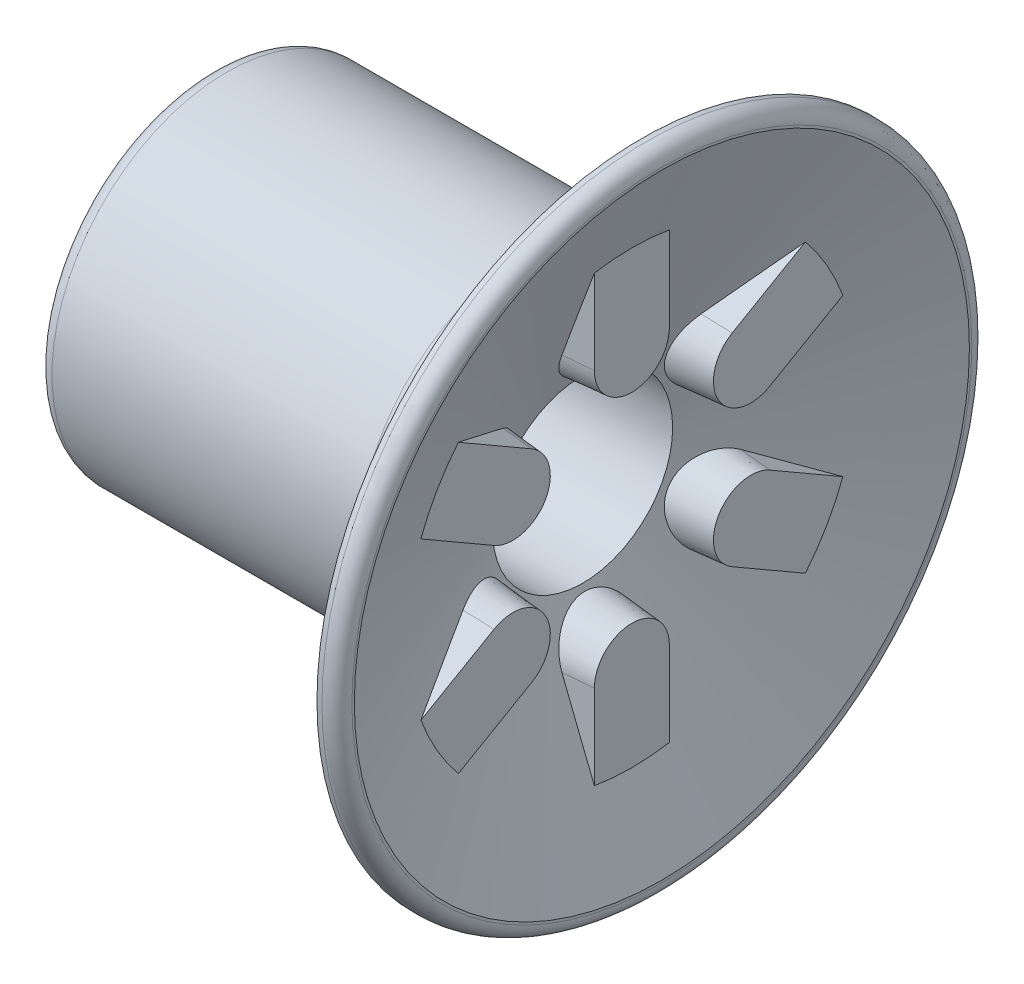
ISO-10303-21;
HEADER;
FILE_DESCRIPTION(('STEP AP214'),'2;1');
FILE_NAME('part.step','',(''),(''),'','','');
FILE_SCHEMA(('AUTOMOTIVE_DESIGN { 1 0 10303 214 1 1 1 1 }'));
ENDSEC;
DATA;
#1=APPLICATION_CONTEXT('core data for automotive mechanical design processes');
#2=APPLICATION_PROTOCOL_DEFINITION('international standard','automotive_design',2000,#1);
#3=PRODUCT_CONTEXT('',#1,'mechanical');
#4=PRODUCT('Part','Part','',(#3));
#5=PRODUCT_RELATED_PRODUCT_CATEGORY('part','',(#4));
#6=PRODUCT_DEFINITION_FORMATION('','',#4);
#7=PRODUCT_DEFINITION_CONTEXT('part definition',#1,'design');
#8=PRODUCT_DEFINITION('design','',#6,#7);
#9=PRODUCT_DEFINITION_SHAPE('','',#8);
#10=(LENGTH_UNIT() NAMED_UNIT(*) SI_UNIT(.MILLI.,.METRE.));
#11=(NAMED_UNIT(*) PLANE_ANGLE_UNIT() SI_UNIT($,.RADIAN.));
#12=(NAMED_UNIT(*) SI_UNIT($,.STERADIAN.) SOLID_ANGLE_UNIT());
#13=UNCERTAINTY_MEASURE_WITH_UNIT(LENGTH_MEASURE(1.E-05),#10,'distance_accuracy_value','');
#14=(GEOMETRIC_REPRESENTATION_CONTEXT(3) GLOBAL_UNCERTAINTY_ASSIGNED_CONTEXT((#13)) GLOBAL_UNIT_ASSIGNED_CONTEXT((#10,
#11,#12)) REPRESENTATION_CONTEXT('',''));
#15=CARTESIAN_POINT('',(0.,0.,0.));
#16=DIRECTION('',(0.,0.,1.));
#17=DIRECTION('',(1.,0.,0.));
#18=AXIS2_PLACEMENT_3D('',#15,#16,#17);
#19=CARTESIAN_POINT('',(-11.43,4.06399999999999,0.));
#20=DIRECTION('',(-1.,0.,0.));
#21=DIRECTION('',(0.,0.,1.));
#22=AXIS2_PLACEMENT_3D('',#19,#20,#21);
#23=PLANE('',#22);
#24=CARTESIAN_POINT('',(-11.43,0.,0.));
#25=DIRECTION('',(1.,0.,0.));
#26=DIRECTION('',(0.,0.,-1.));
#27=AXIS2_PLACEMENT_3D('',#24,#25,#26);
#28=CIRCLE('',#27,1.778);
#29=CARTESIAN_POINT('',(-11.43,0.,-1.778));
#30=VERTEX_POINT('',#29);
#31=EDGE_CURVE('E267',#30,#30,#28,.T.);
#32=ORIENTED_EDGE('',*,*,#31,.T.);
#33=EDGE_LOOP('',(#32));
#34=FACE_BOUND('',#33,.T.);
#35=CARTESIAN_POINT('',(-11.43,0.,0.));
#36=DIRECTION('',(1.,0.,0.));
#37=DIRECTION('',(0.,0.,-1.));
#38=AXIS2_PLACEMENT_3D('',#35,#36,#37);
#39=CIRCLE('',#38,4.06399999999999);
#40=CARTESIAN_POINT('',(-11.43,0.,-4.06399999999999));
#41=VERTEX_POINT('',#40);
#42=EDGE_CURVE('E10',#41,#41,#39,.T.);
#43=ORIENTED_EDGE('',*,*,#42,.F.);
#44=EDGE_LOOP('',(#43));
#45=FACE_BOUND('',#44,.T.);
#46=ADVANCED_FACE('F16',(#34,#45),#23,.T.);
#47=CARTESIAN_POINT('',(-11.049,0.,0.));
#48=DIRECTION('',(1.,0.,0.));
#49=DIRECTION('',(0.,0.,-1.));
#50=AXIS2_PLACEMENT_3D('',#47,#48,#49);
#51=TOROIDAL_SURFACE('',#50,4.064,0.381);
#52=ORIENTED_EDGE('',*,*,#42,.T.);
#53=EDGE_LOOP('',(#52));
#54=FACE_BOUND('',#53,.T.);
#55=CARTESIAN_POINT('',(-11.049,0.,0.));
#56=DIRECTION('',(1.,0.,0.));
#57=DIRECTION('',(0.,0.,-1.));
#58=AXIS2_PLACEMENT_3D('',#55,#56,#57);
#59=CIRCLE('',#58,4.445);
#60=CARTESIAN_POINT('',(-11.049,0.,-4.445));
#61=VERTEX_POINT('',#60);
#62=EDGE_CURVE('E24',#61,#61,#59,.T.);
#63=ORIENTED_EDGE('',*,*,#62,.F.);
#64=EDGE_LOOP('',(#63));
#65=FACE_BOUND('',#64,.T.);
#66=ADVANCED_FACE('F256',(#54,#65),#51,.T.);
#67=CARTESIAN_POINT('',(0.,0.,0.));
#68=DIRECTION('',(1.,0.,0.));
#69=DIRECTION('',(0.,0.,-1.));
#70=AXIS2_PLACEMENT_3D('',#67,#68,#69);
#71=CYLINDRICAL_SURFACE('',#70,4.445);
#72=ORIENTED_EDGE('',*,*,#62,.T.);
#73=EDGE_LOOP('',(#72));
#74=FACE_BOUND('',#73,.T.);
#75=CARTESIAN_POINT('',(-3.29429239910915,0.,0.));
#76=DIRECTION('',(1.,0.,0.));
#77=DIRECTION('',(0.,0.,-1.));
#78=AXIS2_PLACEMENT_3D('',#75,#76,#77);
#79=CIRCLE('',#78,4.445);
#80=CARTESIAN_POINT('',(-3.29429239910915,0.,-4.445));
#81=VERTEX_POINT('',#80);
#82=EDGE_CURVE('E274',#81,#81,#79,.T.);
#83=ORIENTED_EDGE('',*,*,#82,.F.);
#84=EDGE_LOOP('',(#83));
#85=FACE_BOUND('',#84,.T.);
#86=ADVANCED_FACE('F262',(#74,#85),#71,.T.);
#87=CARTESIAN_POINT('',(-3.29429239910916,0.,0.));
#88=DIRECTION('',(1.,0.,0.));
#89=DIRECTION('',(0.,0.,-1.));
#90=AXIS2_PLACEMENT_3D('',#87,#88,#89);
#91=TOROIDAL_SURFACE('',#90,5.461,1.016);
#92=ORIENTED_EDGE('',*,*,#82,.T.);
#93=EDGE_LOOP('',(#92));
#94=FACE_BOUND('',#93,.T.);
#95=CARTESIAN_POINT('',(-2.41441058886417,0.,0.));
#96=DIRECTION('',(1.,0.,0.));
#97=DIRECTION('',(0.,0.,-1.));
#98=AXIS2_PLACEMENT_3D('',#95,#96,#97);
#99=CIRCLE('',#98,4.95299999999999);
#100=CARTESIAN_POINT('',(-2.41441058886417,0.,-4.95299999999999));
#101=VERTEX_POINT('',#100);
#102=EDGE_CURVE('E281',#101,#101,#99,.T.);
#103=ORIENTED_EDGE('',*,*,#102,.F.);
#104=EDGE_LOOP('',(#103));
#105=FACE_BOUND('',#104,.T.);
#106=ADVANCED_FACE('F369',(#94,#105),#91,.F.);
#107=CARTESIAN_POINT('',(-0.508,0.,0.));
#108=DIRECTION('',(1.,0.,0.));
#109=DIRECTION('',(0.,0.,-1.));
#110=AXIS2_PLACEMENT_3D('',#107,#108,#109);
#111=CONICAL_SURFACE('',#110,8.255,1.04719755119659);
#112=ORIENTED_EDGE('',*,*,#102,.T.);
#113=EDGE_LOOP('',(#112));
#114=FACE_BOUND('',#113,.T.);
#115=CARTESIAN_POINT('',(-0.508,0.,0.));
#116=DIRECTION('',(1.,0.,0.));
#117=DIRECTION('',(0.,0.,-1.));
#118=AXIS2_PLACEMENT_3D('',#115,#116,#117);
#119=CIRCLE('',#118,8.255);
#120=CARTESIAN_POINT('',(-0.508,0.,-8.255));
#121=VERTEX_POINT('',#120);
#122=EDGE_CURVE('E287',#121,#121,#119,.T.);
#123=ORIENTED_EDGE('',*,*,#122,.F.);
#124=EDGE_LOOP('',(#123));
#125=FACE_BOUND('',#124,.T.);
#126=ADVANCED_FACE('F365',(#114,#125),#111,.T.);
#127=CARTESIAN_POINT('',(0.,0.,0.));
#128=DIRECTION('',(1.,0.,0.));
#129=DIRECTION('',(0.,0.,-1.));
#130=AXIS2_PLACEMENT_3D('',#127,#128,#129);
#131=CYLINDRICAL_SURFACE('',#130,8.255);
#132=ORIENTED_EDGE('',*,*,#122,.T.);
#133=EDGE_LOOP('',(#132));
#134=FACE_BOUND('',#133,.T.);
#135=CARTESIAN_POINT('',(-0.381000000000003,0.,0.));
#136=DIRECTION('',(1.,0.,0.));
#137=DIRECTION('',(0.,0.,-1.));
#138=AXIS2_PLACEMENT_3D('',#135,#136,#137);
#139=CIRCLE('',#138,8.255);
#140=CARTESIAN_POINT('',(-0.381000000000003,0.,-8.255));
#141=VERTEX_POINT('',#140);
#142=EDGE_CURVE('E291',#141,#141,#139,.T.);
#143=ORIENTED_EDGE('',*,*,#142,.F.);
#144=EDGE_LOOP('',(#143));
#145=FACE_BOUND('',#144,.T.);
#146=ADVANCED_FACE('F361',(#134,#145),#131,.T.);
#147=CARTESIAN_POINT('',(-0.381,0.,0.));
#148=DIRECTION('',(1.,0.,0.));
#149=DIRECTION('',(0.,0.,-1.));
#150=AXIS2_PLACEMENT_3D('',#147,#148,#149);
#151=TOROIDAL_SURFACE('',#150,7.874,0.381);
#152=ORIENTED_EDGE('',*,*,#142,.T.);
#153=EDGE_LOOP('',(#152));
#154=FACE_BOUND('',#153,.T.);
#155=CARTESIAN_POINT('',(0.,0.,0.));
#156=DIRECTION('',(1.,0.,0.));
#157=DIRECTION('',(0.,0.,-1.));
#158=AXIS2_PLACEMENT_3D('',#155,#156,#157);
#159=CIRCLE('',#158,7.874);
#160=CARTESIAN_POINT('',(0.,0.,-7.874));
#161=VERTEX_POINT('',#160);
#162=EDGE_CURVE('E295',#161,#161,#159,.T.);
#163=ORIENTED_EDGE('',*,*,#162,.F.);
#164=EDGE_LOOP('',(#163));
#165=FACE_BOUND('',#164,.T.);
#166=ADVANCED_FACE('F357',(#154,#165),#151,.T.);
#167=CARTESIAN_POINT('',(0.,0.,0.));
#168=DIRECTION('',(1.,0.,0.));
#169=DIRECTION('',(0.,0.,-1.));
#170=AXIS2_PLACEMENT_3D('',#167,#168,#169);
#171=PLANE('',#170);
#172=CARTESIAN_POINT('',(0.,0.,0.));
#173=DIRECTION('',(1.,0.,0.));
#174=DIRECTION('',(0.,0.,-1.));
#175=AXIS2_PLACEMENT_3D('',#172,#173,#174);
#176=CIRCLE('',#175,7.81304);
#177=CARTESIAN_POINT('',(0.,0.,-7.81304));
#178=VERTEX_POINT('',#177);
#179=EDGE_CURVE('E299',#178,#178,#176,.T.);
#180=ORIENTED_EDGE('',*,*,#179,.F.);
#181=EDGE_LOOP('',(#180));
#182=FACE_BOUND('',#181,.T.);
#183=ORIENTED_EDGE('',*,*,#162,.T.);
#184=EDGE_LOOP('',(#183));
#185=FACE_BOUND('',#184,.T.);
#186=ADVANCED_FACE('F353',(#182,#185),#171,.T.);
#187=CARTESIAN_POINT('',(0.,0.,0.));
#188=DIRECTION('',(1.,0.,0.));
#189=DIRECTION('',(0.,0.,-1.));
#190=AXIS2_PLACEMENT_3D('',#187,#188,#189);
#191=CONICAL_SURFACE('',#190,7.81304,1.22173047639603);
#192=CARTESIAN_POINT('',(-2.0116780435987,0.,0.));
#193=DIRECTION('',(1.,0.,0.));
#194=DIRECTION('',(0.,0.,-1.));
#195=AXIS2_PLACEMENT_3D('',#192,#193,#194);
#196=CIRCLE('',#195,2.286);
#197=CARTESIAN_POINT('',(-2.0116780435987,0.,-2.286));
#198=VERTEX_POINT('',#197);
#199=EDGE_CURVE('E1237',#198,#198,#196,.T.);
#200=ORIENTED_EDGE('',*,*,#199,.F.);
#201=EDGE_LOOP('',(#200));
#202=FACE_BOUND('',#201,.T.);
#203=CARTESIAN_POINT('',(-0.761799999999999,1.99520179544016,5.36075588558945));
#204=CARTESIAN_POINT('',(-0.826764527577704,1.89928388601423,5.20598851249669));
#205=CARTESIAN_POINT('',(-0.891630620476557,1.80335567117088,5.05118606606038));
#206=CARTESIAN_POINT('',(-1.02106810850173,1.61146937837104,4.74147788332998));
#207=CARTESIAN_POINT('',(-1.08563950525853,1.51551130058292,4.58657214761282));
#208=CARTESIAN_POINT('',(-1.21439071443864,1.32355463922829,4.27662199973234));
#209=CARTESIAN_POINT('',(-1.27857052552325,1.2275560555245,4.12157758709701));
#210=CARTESIAN_POINT('',(-1.4063416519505,1.03549909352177,3.8112822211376));
#211=CARTESIAN_POINT('',(-1.46993296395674,0.939440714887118,3.65603126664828));
#212=CARTESIAN_POINT('',(-1.53313131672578,0.843343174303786,3.50064372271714));
#213=B_SPLINE_CURVE_WITH_KNOTS('',3,(#203,#204,#205,#206,#207,#208,#209,#210,#211,#212),
.UNSPECIFIED.,.F.,.F.,(4,2,2,2,4),(0.,0.579967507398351,1.15993180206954,1.73989807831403,
2.31986764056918),.UNSPECIFIED.);
#214=CARTESIAN_POINT('',(-0.762,1.99490652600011,5.36027945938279));
#215=VERTEX_POINT('',#214);
#216=CARTESIAN_POINT('',(-1.51956916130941,0.863961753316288,3.53398307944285));
#217=VERTEX_POINT('',#216);
#218=EDGE_CURVE('E197',#215,#217,#213,.T.);
#219=ORIENTED_EDGE('',*,*,#218,.F.);
#220=CARTESIAN_POINT('',(-0.762,0.,0.));
#221=DIRECTION('',(1.,0.,0.));
#222=DIRECTION('',(0.,0.,-1.));
#223=AXIS2_PLACEMENT_3D('',#220,#221,#222);
#224=CIRCLE('',#223,5.7194622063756);
#225=CARTESIAN_POINT('',(-0.762,3.64468492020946,4.40777945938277));
#226=VERTEX_POINT('',#225);
#227=EDGE_CURVE('E183',#226,#215,#224,.T.);
#228=ORIENTED_EDGE('',*,*,#227,.F.);
#229=CARTESIAN_POINT('',(-1.5615978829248,2.57093919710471,2.40808581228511));
#230=CARTESIAN_POINT('',(-1.49616028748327,2.66074635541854,2.57508646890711));
#231=CARTESIAN_POINT('',(-1.43027510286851,2.75044120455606,2.74197091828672));
#232=CARTESIAN_POINT('',(-1.2978417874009,2.9296631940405,3.07556533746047));
#233=CARTESIAN_POINT('',(-1.23129366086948,3.01919033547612,3.24227530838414));
#234=CARTESIAN_POINT('',(-1.09776610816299,3.19813462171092,3.57558019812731));
#235=CARTESIAN_POINT('',(-1.03078668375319,3.28755176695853,3.74217511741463));
#236=CARTESIAN_POINT('',(-0.896506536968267,3.4663048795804,4.07528057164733));
#237=CARTESIAN_POINT('',(-0.829205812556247,3.55564084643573,4.24179110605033));
#238=CARTESIAN_POINT('',(-0.7618,3.64494988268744,4.40827338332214));
#239=B_SPLINE_CURVE_WITH_KNOTS('',3,(#229,#230,#231,#232,#233,#234,#235,#236,#237,#238),
.UNSPECIFIED.,.F.,.F.,(4,2,2,2,4),(0.,0.60177005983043,1.20353619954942,1.80529987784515,
2.40706737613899),.UNSPECIFIED.);
#240=CARTESIAN_POINT('',(-1.51956916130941,2.62853824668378,2.51520436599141));
#241=VERTEX_POINT('',#240);
#242=EDGE_CURVE('E206',#241,#226,#239,.T.);
#243=ORIENTED_EDGE('',*,*,#242,.F.);
#244=CARTESIAN_POINT('',(-1.3108062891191,1.41236171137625,3.96775199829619));
#245=CARTESIAN_POINT('',(-1.31744891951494,1.38420774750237,3.95840174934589));
#246=CARTESIAN_POINT('',(-1.32437359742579,1.35653805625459,3.94784912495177));
#247=CARTESIAN_POINT('',(-1.33875452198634,1.3023393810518,3.92445058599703));
#248=CARTESIAN_POINT('',(-1.34621061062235,1.27581006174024,3.91160535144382));
#249=CARTESIAN_POINT('',(-1.36928314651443,1.19833483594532,3.86987927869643));
#250=CARTESIAN_POINT('',(-1.3856475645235,1.14931606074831,3.83774567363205));
#251=CARTESIAN_POINT('',(-1.41999811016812,1.05784935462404,3.76602412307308));
#252=CARTESIAN_POINT('',(-1.43798308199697,1.01539679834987,3.72644146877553));
#253=CARTESIAN_POINT('',(-1.47525130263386,0.937957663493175,3.64104205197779));
#254=CARTESIAN_POINT('',(-1.49453512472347,0.902974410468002,3.59522252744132));
#255=CARTESIAN_POINT('',(-1.53480879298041,0.840027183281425,3.49675427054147));
#256=CARTESIAN_POINT('',(-1.55583602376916,0.812399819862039,3.44390572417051));
#257=CARTESIAN_POINT('',(-1.59841981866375,0.766690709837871,3.33442391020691));
#258=CARTESIAN_POINT('',(-1.61997650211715,0.74861113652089,3.27778978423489));
#259=CARTESIAN_POINT('',(-1.6638138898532,0.721993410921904,3.1603269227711));
#260=CARTESIAN_POINT('',(-1.68609476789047,0.71379352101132,3.09942128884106));
#261=CARTESIAN_POINT('',(-1.72998039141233,0.708348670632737,2.97686334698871));
#262=CARTESIAN_POINT('',(-1.75158503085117,0.7111054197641,2.91521092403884));
#263=CARTESIAN_POINT('',(-1.79326862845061,0.727720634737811,2.79291640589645));
#264=CARTESIAN_POINT('',(-1.81334850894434,0.741572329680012,2.73227371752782));
#265=CARTESIAN_POINT('',(-1.8509625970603,0.780363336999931,2.61377885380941));
#266=CARTESIAN_POINT('',(-1.8684973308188,0.805300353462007,2.55592610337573));
#267=CARTESIAN_POINT('',(-1.89886208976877,0.864192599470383,2.44827887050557));
#268=CARTESIAN_POINT('',(-1.91190764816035,0.897533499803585,2.39821081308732));
#269=CARTESIAN_POINT('',(-1.93351749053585,0.973132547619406,2.30422741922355));
#270=CARTESIAN_POINT('',(-1.94208674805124,1.01538072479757,2.26030529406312));
#271=CARTESIAN_POINT('',(-1.95319186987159,1.10249963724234,2.18483995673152));
#272=CARTESIAN_POINT('',(-1.95628288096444,1.14658449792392,2.15246974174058));
#273=CARTESIAN_POINT('',(-1.95787889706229,1.23946400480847,2.09526415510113));
#274=CARTESIAN_POINT('',(-1.95638582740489,1.28825666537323,2.07042562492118));
#275=CARTESIAN_POINT('',(-1.9492326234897,1.38535853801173,2.03049292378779));
#276=CARTESIAN_POINT('',(-1.94387226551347,1.43346139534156,2.01483726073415));
#277=CARTESIAN_POINT('',(-1.92975912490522,1.53097908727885,1.9909113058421));
#278=CARTESIAN_POINT('',(-1.9210057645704,1.58039414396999,1.98264227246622));
#279=CARTESIAN_POINT('',(-1.90029271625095,1.68129728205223,1.97324273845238));
#280=CARTESIAN_POINT('',(-1.88821864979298,1.73278912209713,1.97241141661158));
#281=CARTESIAN_POINT('',(-1.86174689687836,1.83471570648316,1.97836932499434));
#282=CARTESIAN_POINT('',(-1.84734837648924,1.88515006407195,1.98516129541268));
#283=CARTESIAN_POINT('',(-1.81531723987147,1.98903625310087,2.00702298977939));
#284=CARTESIAN_POINT('',(-1.79750448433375,2.04226956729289,2.02286787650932));
#285=CARTESIAN_POINT('',(-1.7605874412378,2.14512428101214,2.06268904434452));
#286=CARTESIAN_POINT('',(-1.74148262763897,2.1947441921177,2.08666865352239));
#287=CARTESIAN_POINT('',(-1.70091004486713,2.29345010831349,2.14447842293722));
#288=CARTESIAN_POINT('',(-1.67938090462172,2.34211791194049,2.17898170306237));
#289=CARTESIAN_POINT('',(-1.63617686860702,2.43276270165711,2.25580929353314));
#290=CARTESIAN_POINT('',(-1.61450193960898,2.47473810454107,2.29813544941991));
#291=CARTESIAN_POINT('',(-1.57080182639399,2.55219770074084,2.39111574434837));
#292=CARTESIAN_POINT('',(-1.54879097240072,2.58740298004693,2.44200968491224));
#293=CARTESIAN_POINT('',(-1.50573610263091,2.64826886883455,2.54959538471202));
#294=CARTESIAN_POINT('',(-1.48469208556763,2.6739294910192,2.60628713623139));
#295=CARTESIAN_POINT('',(-1.44430980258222,2.71444652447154,2.72309384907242));
#296=CARTESIAN_POINT('',(-1.42495325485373,2.7294361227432,2.78315613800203));
#297=CARTESIAN_POINT('',(-1.38808127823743,2.74837833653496,2.90555091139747));
#298=CARTESIAN_POINT('',(-1.37056543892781,2.75233341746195,2.96788288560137));
#299=CARTESIAN_POINT('',(-1.33844506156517,2.74882325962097,3.09025000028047));
#300=CARTESIAN_POINT('',(-1.32375064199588,2.74181932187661,3.15027460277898));
#301=CARTESIAN_POINT('',(-1.29674448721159,2.71715387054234,3.2686527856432));
#302=CARTESIAN_POINT('',(-1.28443208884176,2.6994953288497,3.3270068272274));
#303=CARTESIAN_POINT('',(-1.26301383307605,2.6549468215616,3.43728175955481));
#304=CARTESIAN_POINT('',(-1.25378046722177,2.62855131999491,3.48937774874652));
#305=CARTESIAN_POINT('',(-1.23793142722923,2.56701046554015,3.58856752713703));
#306=CARTESIAN_POINT('',(-1.23131525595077,2.53186677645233,3.63566226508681));
#307=CARTESIAN_POINT('',(-1.22106611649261,2.45540428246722,3.72148009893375));
#308=CARTESIAN_POINT('',(-1.21732309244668,2.41439353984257,3.7604651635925));
#309=CARTESIAN_POINT('',(-1.21247228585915,2.32638503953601,3.83113470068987));
#310=CARTESIAN_POINT('',(-1.21136227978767,2.27939236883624,3.86282531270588));
#311=CARTESIAN_POINT('',(-1.21169988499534,2.20217766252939,3.90602123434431));
#312=CARTESIAN_POINT('',(-1.21224967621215,2.17348191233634,3.92033199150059));
#313=CARTESIAN_POINT('',(-1.21419599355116,2.11494229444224,3.94615487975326));
#314=CARTESIAN_POINT('',(-1.21559110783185,2.08510041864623,3.95767163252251));
#315=CARTESIAN_POINT('',(-1.21740568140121,2.05478973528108,3.96775199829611));
#316=B_SPLINE_CURVE_WITH_KNOTS('',3,(#244,#245,#246,#247,#248,#249,#250,#251,#252,#253,#254,
#255,#256,#257,#258,#259,#260,#261,#262,#263,#264,#265,#266,#267,#268,#269,#270,#271,#272,#273,
#274,#275,#276,#277,#278,#279,#280,#281,#282,#283,#284,#285,#286,#287,#288,#289,#290,#291,#292,
#293,#294,#295,#296,#297,#298,#299,#300,#301,#302,#303,#304,#305,#306,#307,#308,#309,#310,#311,
#312,#313,#314,#315),.UNSPECIFIED.,.F.,.F.,(4,2,2,2,2,2,2,2,2,2,2,2,2,2,2,2,2,2,2,2,2,2,2,2,2,2,
2,2,2,2,2,2,2,2,2,4),(0.,0.0911406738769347,0.18225435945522,0.363887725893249,
0.545392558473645,0.726978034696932,0.915824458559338,1.10471384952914,1.29990177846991,
1.49512016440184,1.69021950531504,1.88527845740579,2.06890321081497,2.25232350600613,
2.41578099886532,2.57916984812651,2.73109289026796,2.88304181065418,3.04107661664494,
3.19916824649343,3.37341953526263,3.54774219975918,3.73715810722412,3.92661875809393,
4.12271659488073,4.31881417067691,4.51241913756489,4.70598084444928,4.89161146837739,
5.07719033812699,5.25368048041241,5.4301370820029,5.59944082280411,5.76860153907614,
5.86467602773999,5.96059049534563),.UNSPECIFIED.);
#317=EDGE_CURVE('E204',#217,#241,#316,.T.);
#318=ORIENTED_EDGE('',*,*,#317,.F.);
#319=EDGE_LOOP('',(#219,#228,#243,#318));
#320=FACE_BOUND('',#319,.T.);
#321=CARTESIAN_POINT('',(-0.7618,-3.64494988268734,4.40827338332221));
#322=CARTESIAN_POINT('',(-0.829205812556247,-3.55564084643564,4.2417911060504));
#323=CARTESIAN_POINT('',(-0.896506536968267,-3.46630487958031,4.07528057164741));
#324=CARTESIAN_POINT('',(-1.03078668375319,-3.28755176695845,3.7421751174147));
#325=CARTESIAN_POINT('',(-1.09776610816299,-3.19813462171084,3.57558019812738));
#326=CARTESIAN_POINT('',(-1.23129366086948,-3.01919033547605,3.2422753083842));
#327=CARTESIAN_POINT('',(-1.2978417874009,-2.92966319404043,3.07556533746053));
#328=CARTESIAN_POINT('',(-1.43027510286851,-2.750441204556,2.74197091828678));
#329=CARTESIAN_POINT('',(-1.49616028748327,-2.66074635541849,2.57508646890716));
#330=CARTESIAN_POINT('',(-1.56159788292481,-2.57093919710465,2.40808581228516));
#331=B_SPLINE_CURVE_WITH_KNOTS('',3,(#321,#322,#323,#324,#325,#326,#327,#328,#329,#330),
.UNSPECIFIED.,.F.,.F.,(4,2,2,2,4),(0.,0.601767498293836,1.20353117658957,1.80529731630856,
2.40706737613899),.UNSPECIFIED.);
#332=CARTESIAN_POINT('',(-0.762,-3.64468492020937,4.40777945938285));
#333=VERTEX_POINT('',#332);
#334=CARTESIAN_POINT('',(-1.51956916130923,-2.62853824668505,2.51520436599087));
#335=VERTEX_POINT('',#334);
#336=EDGE_CURVE('E876',#333,#335,#331,.T.);
#337=ORIENTED_EDGE('',*,*,#336,.F.);
#338=CARTESIAN_POINT('',(-0.762,0.,0.));
#339=DIRECTION('',(1.,0.,0.));
#340=DIRECTION('',(0.,0.,-1.));
#341=AXIS2_PLACEMENT_3D('',#338,#339,#340);
#342=CIRCLE('',#341,5.7194622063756);
#343=CARTESIAN_POINT('',(-0.762,-1.994906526,5.36027945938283));
#344=VERTEX_POINT('',#343);
#345=EDGE_CURVE('E903',#344,#333,#342,.T.);
#346=ORIENTED_EDGE('',*,*,#345,.F.);
#347=CARTESIAN_POINT('',(-1.53313131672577,-0.843343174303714,3.50064372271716));
#348=CARTESIAN_POINT('',(-1.46993296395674,-0.939440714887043,3.6560312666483));
#349=CARTESIAN_POINT('',(-1.4063416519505,-1.03549909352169,3.81128222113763));
#350=CARTESIAN_POINT('',(-1.27857052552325,-1.22755605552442,4.12157758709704));
#351=CARTESIAN_POINT('',(-1.21439071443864,-1.3235546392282,4.27662199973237));
#352=CARTESIAN_POINT('',(-1.08563950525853,-1.51551130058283,4.58657214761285));
#353=CARTESIAN_POINT('',(-1.02106810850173,-1.61146937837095,4.74147788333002));
#354=CARTESIAN_POINT('',(-0.891630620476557,-1.80335567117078,5.05118606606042));
#355=CARTESIAN_POINT('',(-0.826764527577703,-1.89928388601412,5.20598851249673));
#356=CARTESIAN_POINT('',(-0.761799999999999,-1.99520179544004,5.3607558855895));
#357=B_SPLINE_CURVE_WITH_KNOTS('',3,(#347,#348,#349,#350,#351,#352,#353,#354,#355,#356),
.UNSPECIFIED.,.F.,.F.,(4,2,2,2,4),(0.,0.579969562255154,1.15993583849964,1.73990013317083,
2.31986764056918),.UNSPECIFIED.);
#358=CARTESIAN_POINT('',(-1.51956916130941,-0.863961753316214,3.53398307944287));
#359=VERTEX_POINT('',#358);
#360=EDGE_CURVE('E884',#359,#344,#357,.T.);
#361=ORIENTED_EDGE('',*,*,#360,.F.);
#362=CARTESIAN_POINT('',(-1.21740568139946,-2.05478973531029,3.96775199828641));
#363=CARTESIAN_POINT('',(-1.21584149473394,-2.08092127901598,3.95905978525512));
#364=CARTESIAN_POINT('',(-1.21458874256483,-2.10670379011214,3.94930281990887));
#365=CARTESIAN_POINT('',(-1.21271110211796,-2.15740988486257,3.92771979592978));
#366=CARTESIAN_POINT('',(-1.21208618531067,-2.18233350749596,3.91589383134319));
#367=CARTESIAN_POINT('',(-1.21116180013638,-2.25547609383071,3.87745542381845));
#368=CARTESIAN_POINT('',(-1.21180611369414,-2.30217748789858,3.84784556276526));
#369=CARTESIAN_POINT('',(-1.21560678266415,-2.39010046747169,3.7815131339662));
#370=CARTESIAN_POINT('',(-1.21876432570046,-2.43131945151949,3.74478720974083));
#371=CARTESIAN_POINT('',(-1.22752406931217,-2.5071632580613,3.6653182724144));
#372=CARTESIAN_POINT('',(-1.23312598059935,-2.54178886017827,3.62257597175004));
#373=CARTESIAN_POINT('',(-1.24670423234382,-2.60378329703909,3.53204316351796));
#374=CARTESIAN_POINT('',(-1.25469599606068,-2.63110274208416,3.48422120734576));
#375=CARTESIAN_POINT('',(-1.27288126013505,-2.67758928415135,3.38515211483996));
#376=CARTESIAN_POINT('',(-1.28307532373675,-2.69675429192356,3.33390410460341));
#377=CARTESIAN_POINT('',(-1.30578184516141,-2.72701736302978,3.22796955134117));
#378=CARTESIAN_POINT('',(-1.31835080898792,-2.73787670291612,3.17322704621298));
#379=CARTESIAN_POINT('',(-1.34536768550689,-2.75057513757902,3.06317217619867));
#380=CARTESIAN_POINT('',(-1.35981580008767,-2.7524132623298,3.00785975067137));
#381=CARTESIAN_POINT('',(-1.3909727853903,-2.74714852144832,2.8957918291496));
#382=CARTESIAN_POINT('',(-1.40775121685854,-2.73966606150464,2.83907358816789));
#383=CARTESIAN_POINT('',(-1.44274689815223,-2.71556136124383,2.72807806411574));
#384=CARTESIAN_POINT('',(-1.46096450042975,-2.69893687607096,2.67380138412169));
#385=CARTESIAN_POINT('',(-1.49938264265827,-2.65619986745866,2.56656719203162));
#386=CARTESIAN_POINT('',(-1.51963614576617,-2.62967790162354,2.51379176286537));
#387=CARTESIAN_POINT('',(-1.56092683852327,-2.56820253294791,2.41374513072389));
#388=CARTESIAN_POINT('',(-1.58196419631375,-2.53324731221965,2.36647511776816));
#389=CARTESIAN_POINT('',(-1.62518035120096,-2.45440592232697,2.27691117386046));
#390=CARTESIAN_POINT('',(-1.64737173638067,-2.41022548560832,2.23488199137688));
#391=CARTESIAN_POINT('',(-1.691494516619,-2.31507095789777,2.15919163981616));
#392=CARTESIAN_POINT('',(-1.71342586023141,-2.26409554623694,2.12553210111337));
#393=CARTESIAN_POINT('',(-1.75655770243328,-2.15603057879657,2.06726662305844));
#394=CARTESIAN_POINT('',(-1.77774647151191,-2.09887577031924,2.04277261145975));
#395=CARTESIAN_POINT('',(-1.81819188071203,-1.98044012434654,2.00437230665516));
#396=CARTESIAN_POINT('',(-1.83744851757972,-1.91915927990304,1.99046603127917));
#397=CARTESIAN_POINT('',(-1.87218107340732,-1.79667924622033,1.97443370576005));
#398=CARTESIAN_POINT('',(-1.88777675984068,-1.73557344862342,1.971861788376));
#399=CARTESIAN_POINT('',(-1.91494609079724,-1.61301752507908,1.97788968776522));
#400=CARTESIAN_POINT('',(-1.92652354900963,-1.55156778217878,1.9864788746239));
#401=CARTESIAN_POINT('',(-1.94361384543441,-1.43660836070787,2.01358813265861));
#402=CARTESIAN_POINT('',(-1.94961654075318,-1.38291821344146,2.03103180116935));
#403=CARTESIAN_POINT('',(-1.95683554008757,-1.27895130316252,2.07478967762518));
#404=CARTESIAN_POINT('',(-1.95805535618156,-1.22867206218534,2.10109736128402));
#405=CARTESIAN_POINT('',(-1.95570354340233,-1.13778524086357,2.15885128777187));
#406=CARTESIAN_POINT('',(-1.9525681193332,-1.09671298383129,2.18958957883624));
#407=CARTESIAN_POINT('',(-1.94254418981,-1.01993819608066,2.25664253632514));
#408=CARTESIAN_POINT('',(-1.93565536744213,-0.984236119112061,2.2929576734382));
#409=CARTESIAN_POINT('',(-1.91858796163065,-0.918710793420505,2.37035340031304));
#410=CARTESIAN_POINT('',(-1.9083836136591,-0.888936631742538,2.41146964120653));
#411=CARTESIAN_POINT('',(-1.88535714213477,-0.836065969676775,2.49710945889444));
#412=CARTESIAN_POINT('',(-1.87253420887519,-0.812971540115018,2.54163408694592));
#413=CARTESIAN_POINT('',(-1.84363085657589,-0.771856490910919,2.63730308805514));
#414=CARTESIAN_POINT('',(-1.82735835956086,-0.754507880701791,2.68867793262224));
#415=CARTESIAN_POINT('',(-1.79320783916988,-0.72815084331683,2.79300597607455));
#416=CARTESIAN_POINT('',(-1.77532915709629,-0.719145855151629,2.84595981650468));
#417=CARTESIAN_POINT('',(-1.73680959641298,-0.708986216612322,2.95746061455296));
#418=CARTESIAN_POINT('',(-1.71606908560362,-0.708678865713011,3.01605133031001));
#419=CARTESIAN_POINT('',(-1.67409977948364,-0.71792997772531,3.13227649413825));
#420=CARTESIAN_POINT('',(-1.65287083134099,-0.72749157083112,3.18991063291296));
#421=CARTESIAN_POINT('',(-1.60941149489,-0.756942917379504,3.30566190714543));
#422=CARTESIAN_POINT('',(-1.58718526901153,-0.777334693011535,3.36365367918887));
#423=CARTESIAN_POINT('',(-1.54338925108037,-0.828219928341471,3.47530640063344));
#424=CARTESIAN_POINT('',(-1.52181954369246,-0.858714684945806,3.52896679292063));
#425=CARTESIAN_POINT('',(-1.47984308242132,-0.929062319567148,3.63026995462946));
#426=CARTESIAN_POINT('',(-1.45943616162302,-0.96891385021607,3.67791358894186));
#427=CARTESIAN_POINT('',(-1.42025108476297,-1.05694460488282,3.76552955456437));
#428=CARTESIAN_POINT('',(-1.40147154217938,-1.10511663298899,3.80550845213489));
#429=CARTESIAN_POINT('',(-1.37028547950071,-1.19584851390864,3.86766628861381));
#430=CARTESIAN_POINT('',(-1.3574395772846,-1.23692535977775,3.89180969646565));
#431=CARTESIAN_POINT('',(-1.3330815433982,-1.32236085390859,3.93428273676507));
#432=CARTESIAN_POINT('',(-1.32156977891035,-1.3667204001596,3.95261077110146));
#433=CARTESIAN_POINT('',(-1.31080628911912,-1.41236171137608,3.96775199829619));
#434=B_SPLINE_CURVE_WITH_KNOTS('',3,(#362,#363,#364,#365,#366,#367,#368,#369,#370,#371,#372,
#373,#374,#375,#376,#377,#378,#379,#380,#381,#382,#383,#384,#385,#386,#387,#388,#389,#390,#391,
#392,#393,#394,#395,#396,#397,#398,#399,#400,#401,#402,#403,#404,#405,#406,#407,#408,#409,#410,
#411,#412,#413,#414,#415,#416,#417,#418,#419,#420,#421,#422,#423,#424,#425,#426,#427,#428,#429,
#430,#431,#432,#433),.UNSPECIFIED.,.F.,.F.,(4,2,2,2,2,2,2,2,2,2,2,2,2,2,2,2,2,2,2,2,2,2,2,2,2,2,
2,2,2,2,2,2,2,2,2,4),(0.,0.0827008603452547,0.165397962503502,0.330445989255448,
0.495572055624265,0.660678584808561,0.826874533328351,0.993113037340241,1.16396661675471,
1.33483856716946,1.51290273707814,1.69101065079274,1.87749476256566,2.0640191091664,
2.25779169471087,2.45160199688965,2.6477072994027,2.8438129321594,3.03213115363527,
3.22027015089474,3.38963688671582,3.55887923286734,3.71233937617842,3.86581247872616,
4.02050792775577,4.17525128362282,4.34439240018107,4.51360320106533,4.69924664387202,
4.88494898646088,5.08012524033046,5.2753265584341,5.47049978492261,5.66550505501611,
5.81309934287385,5.9607341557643),.UNSPECIFIED.);
#435=EDGE_CURVE('E864',#335,#359,#434,.T.);
#436=ORIENTED_EDGE('',*,*,#435,.F.);
#437=EDGE_LOOP('',(#337,#346,#361,#436));
#438=FACE_BOUND('',#437,.T.);
#439=CARTESIAN_POINT('',(-0.7618,-5.64015167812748,-0.952482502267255));
#440=CARTESIAN_POINT('',(-0.825609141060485,-5.46139777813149,-0.958065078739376));
#441=CARTESIAN_POINT('',(-0.889322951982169,-5.28260947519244,-0.963639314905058));
#442=CARTESIAN_POINT('',(-1.01646795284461,-4.92493270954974,-0.974763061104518));
#443=CARTESIAN_POINT('',(-1.07989914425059,-4.74604424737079,-0.980312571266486));
#444=CARTESIAN_POINT('',(-1.20638780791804,-4.38813339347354,-0.991378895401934));
#445=CARTESIAN_POINT('',(-1.2694452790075,-4.20911100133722,-0.996895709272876));
#446=CARTESIAN_POINT('',(-1.39500438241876,-3.8508689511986,-1.00788070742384));
#447=CARTESIAN_POINT('',(-1.45750601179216,-3.67164929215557,-1.01334889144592));
#448=CARTESIAN_POINT('',(-1.51963842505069,-3.49230000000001,-1.01878477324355));
#449=B_SPLINE_CURVE_WITH_KNOTS('',3,(#439,#440,#441,#442,#443,#444,#445,#446,#447,#448),
.UNSPECIFIED.,.F.,.F.,(4,2,2,2,4),(0.,0.569650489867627,1.13929802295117,1.70894734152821,
2.27859967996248),.UNSPECIFIED.);
#450=CARTESIAN_POINT('',(-0.762,-5.63959144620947,-0.95249999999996));
#451=VERTEX_POINT('',#450);
#452=CARTESIAN_POINT('',(-1.51956916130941,-3.49250000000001,-1.01877871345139));
#453=VERTEX_POINT('',#452);
#454=EDGE_CURVE('E823',#451,#453,#449,.T.);
#455=ORIENTED_EDGE('',*,*,#454,.F.);
#456=CARTESIAN_POINT('',(-0.762,0.,0.));
#457=DIRECTION('',(1.,0.,0.));
#458=DIRECTION('',(0.,0.,-1.));
#459=AXIS2_PLACEMENT_3D('',#456,#457,#458);
#460=CIRCLE('',#459,5.7194622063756);
#461=CARTESIAN_POINT('',(-0.762,-5.63959144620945,0.952500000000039));
#462=VERTEX_POINT('',#461);
#463=EDGE_CURVE('E847',#462,#451,#460,.T.);
#464=ORIENTED_EDGE('',*,*,#463,.F.);
#465=CARTESIAN_POINT('',(-1.5196384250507,-3.49229999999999,1.0187847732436));
#466=CARTESIAN_POINT('',(-1.45750601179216,-3.67164929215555,1.01334889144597));
#467=CARTESIAN_POINT('',(-1.39500438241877,-3.85086895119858,1.0078807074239));
#468=CARTESIAN_POINT('',(-1.2694452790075,-4.2091110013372,0.996895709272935));
#469=CARTESIAN_POINT('',(-1.20638780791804,-4.38813339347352,0.991378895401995));
#470=CARTESIAN_POINT('',(-1.07989914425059,-4.74604424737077,0.980312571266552));
#471=CARTESIAN_POINT('',(-1.01646795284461,-4.92493270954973,0.974763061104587));
#472=CARTESIAN_POINT('',(-0.889322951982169,-5.28260947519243,0.963639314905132));
#473=CARTESIAN_POINT('',(-0.825609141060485,-5.46139777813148,0.958065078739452));
#474=CARTESIAN_POINT('',(-0.761799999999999,-5.64015167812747,0.952482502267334));
#475=B_SPLINE_CURVE_WITH_KNOTS('',3,(#465,#466,#467,#468,#469,#470,#471,#472,#473,#474),
.UNSPECIFIED.,.F.,.F.,(4,2,2,2,4),(0.,0.569652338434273,1.13930165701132,1.70894919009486,
2.27859967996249),.UNSPECIFIED.);
#476=CARTESIAN_POINT('',(-1.51956916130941,-3.49249999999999,1.01877871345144));
#477=VERTEX_POINT('',#476);
#478=EDGE_CURVE('E829',#477,#462,#475,.T.);
#479=ORIENTED_EDGE('',*,*,#478,.F.);
#480=CARTESIAN_POINT('',(-1.51949989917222,-3.49270000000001,-1.01877263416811));
#481=CARTESIAN_POINT('',(-1.5408409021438,-3.43101684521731,-1.02068710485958));
#482=CARTESIAN_POINT('',(-1.56271544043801,-3.36938101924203,-1.01697887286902));
#483=CARTESIAN_POINT('',(-1.60694684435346,-3.24792655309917,-0.998736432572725));
#484=CARTESIAN_POINT('',(-1.6293035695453,-3.18810739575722,-0.984205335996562));
#485=CARTESIAN_POINT('',(-1.67393019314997,-3.07196446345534,-0.944734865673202));
#486=CARTESIAN_POINT('',(-1.69620008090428,-3.01564110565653,-0.919794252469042));
#487=CARTESIAN_POINT('',(-1.7399408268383,-2.90808976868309,-0.860120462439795));
#488=CARTESIAN_POINT('',(-1.76141168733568,-2.85686177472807,-0.825387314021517));
#489=CARTESIAN_POINT('',(-1.80259195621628,-2.76129207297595,-0.747065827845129));
#490=CARTESIAN_POINT('',(-1.82230911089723,-2.7169193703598,-0.703519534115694));
#491=CARTESIAN_POINT('',(-1.85903327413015,-2.63633944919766,-0.608418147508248));
#492=CARTESIAN_POINT('',(-1.87604082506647,-2.60013059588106,-0.556864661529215));
#493=CARTESIAN_POINT('',(-1.90512878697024,-2.53946779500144,-0.450566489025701));
#494=CARTESIAN_POINT('',(-1.91745394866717,-2.51441223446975,-0.396233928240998));
#495=CARTESIAN_POINT('',(-1.9375304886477,-2.47411958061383,-0.283266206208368));
#496=CARTESIAN_POINT('',(-1.94528712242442,-2.45887120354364,-0.224636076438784));
#497=CARTESIAN_POINT('',(-1.95483604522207,-2.44017946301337,-0.111722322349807));
#498=CARTESIAN_POINT('',(-1.95719009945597,-2.43562296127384,-0.0576690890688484));
#499=CARTESIAN_POINT('',(-1.9573864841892,-2.43524094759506,0.0504692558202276));
#500=CARTESIAN_POINT('',(-1.95523031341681,-2.43941253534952,0.104554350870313));
#501=CARTESIAN_POINT('',(-1.94689593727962,-2.45571827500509,0.207657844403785));
#502=CARTESIAN_POINT('',(-1.94097889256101,-2.46733578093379,0.256781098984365));
#503=CARTESIAN_POINT('',(-1.92584315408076,-2.49751688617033,0.352299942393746));
#504=CARTESIAN_POINT('',(-1.91662384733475,-2.51608177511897,0.398695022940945));
#505=CARTESIAN_POINT('',(-1.8949827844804,-2.56051282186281,0.489903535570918));
#506=CARTESIAN_POINT('',(-1.88242916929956,-2.58668519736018,0.534535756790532));
#507=CARTESIAN_POINT('',(-1.85507511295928,-2.64504664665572,0.618898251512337));
#508=CARTESIAN_POINT('',(-1.84027390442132,-2.67723777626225,0.658626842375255));
#509=CARTESIAN_POINT('',(-1.80745899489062,-2.75037489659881,0.736373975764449));
#510=CARTESIAN_POINT('',(-1.78927138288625,-2.79188179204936,0.773791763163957));
#511=CARTESIAN_POINT('',(-1.75168458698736,-2.88004929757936,0.841240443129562));
#512=CARTESIAN_POINT('',(-1.73228466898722,-2.92671304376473,0.871266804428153));
#513=CARTESIAN_POINT('',(-1.69123812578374,-3.02812904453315,0.925566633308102));
#514=CARTESIAN_POINT('',(-1.66953941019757,-3.08323140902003,0.949147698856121));
#515=CARTESIAN_POINT('',(-1.62609900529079,-3.19663764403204,0.986409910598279));
#516=CARTESIAN_POINT('',(-1.60435737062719,-3.25493865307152,1.00009975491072));
#517=CARTESIAN_POINT('',(-1.57214192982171,-3.34355431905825,1.01292167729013));
#518=CARTESIAN_POINT('',(-1.56147057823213,-3.37328412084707,1.0159102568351));
#519=CARTESIAN_POINT('',(-1.54032780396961,-3.43290399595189,1.01928914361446));
#520=CARTESIAN_POINT('',(-1.52985607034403,-3.4627937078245,1.01968388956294));
#521=CARTESIAN_POINT('',(-1.51949989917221,-3.49270000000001,1.01877263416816));
#522=B_SPLINE_CURVE_WITH_KNOTS('',3,(#480,#481,#482,#483,#484,#485,#486,#487,#488,#489,#490,
#491,#492,#493,#494,#495,#496,#497,#498,#499,#500,#501,#502,#503,#504,#505,#506,#507,#508,#509,
#510,#511,#512,#513,#514,#515,#516,#517,#518,#519,#520,#521),.UNSPECIFIED.,.F.,.F.,(4,2,2,2,2,2,
2,2,2,2,2,2,2,2,2,2,2,2,2,2,4),(0.,0.195611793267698,0.391167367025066,0.586746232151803,
0.782324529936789,0.976990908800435,1.17161827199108,1.35385468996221,1.53588105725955,
1.69790407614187,1.85987326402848,2.01166802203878,2.16349097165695,2.322561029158,
2.48168551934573,2.6572502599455,2.8329223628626,3.02330684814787,3.21352370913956,
3.30861470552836,3.40354293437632),.UNSPECIFIED.);
#523=EDGE_CURVE('E810',#453,#477,#522,.T.);
#524=ORIENTED_EDGE('',*,*,#523,.F.);
#525=EDGE_LOOP('',(#455,#464,#479,#524));
#526=FACE_BOUND('',#525,.T.);
#527=CARTESIAN_POINT('',(-0.7618,-1.99520179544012,-5.36075588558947));
#528=CARTESIAN_POINT('',(-0.826764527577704,-1.89928388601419,-5.2059885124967));
#529=CARTESIAN_POINT('',(-0.891630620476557,-1.80335567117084,-5.05118606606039));
#530=CARTESIAN_POINT('',(-1.02106810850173,-1.61146937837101,-4.74147788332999));
#531=CARTESIAN_POINT('',(-1.08563950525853,-1.51551130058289,-4.58657214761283));
#532=CARTESIAN_POINT('',(-1.21439071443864,-1.32355463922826,-4.27662199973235));
#533=CARTESIAN_POINT('',(-1.27857052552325,-1.22755605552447,-4.12157758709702));
#534=CARTESIAN_POINT('',(-1.4063416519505,-1.03549909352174,-3.81128222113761));
#535=CARTESIAN_POINT('',(-1.46993296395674,-0.939440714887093,-3.65603126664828));
#536=CARTESIAN_POINT('',(-1.53313131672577,-0.843343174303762,-3.50064372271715));
#537=B_SPLINE_CURVE_WITH_KNOTS('',3,(#527,#528,#529,#530,#531,#532,#533,#534,#535,#536),
.UNSPECIFIED.,.F.,.F.,(4,2,2,2,4),(0.,0.57996750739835,1.15993180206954,1.73989807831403,
2.31986764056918),.UNSPECIFIED.);
#538=CARTESIAN_POINT('',(-0.762,-1.99490652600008,-5.3602794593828));
#539=VERTEX_POINT('',#538);
#540=CARTESIAN_POINT('',(-1.5195691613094,-0.863961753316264,-3.53398307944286));
#541=VERTEX_POINT('',#540);
#542=EDGE_CURVE('E760',#539,#541,#537,.T.);
#543=ORIENTED_EDGE('',*,*,#542,.F.);
#544=CARTESIAN_POINT('',(-0.762,0.,0.));
#545=DIRECTION('',(1.,0.,0.));
#546=DIRECTION('',(0.,0.,-1.));
#547=AXIS2_PLACEMENT_3D('',#544,#545,#546);
#548=CIRCLE('',#547,5.7194622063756);
#549=CARTESIAN_POINT('',(-0.762,-3.64468492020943,-4.4077794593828));
#550=VERTEX_POINT('',#549);
#551=EDGE_CURVE('E791',#550,#539,#548,.T.);
#552=ORIENTED_EDGE('',*,*,#551,.F.);
#553=CARTESIAN_POINT('',(-1.5615978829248,-2.57093919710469,-2.40808581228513));
#554=CARTESIAN_POINT('',(-1.49616028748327,-2.66074635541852,-2.57508646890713));
#555=CARTESIAN_POINT('',(-1.43027510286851,-2.75044120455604,-2.74197091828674));
#556=CARTESIAN_POINT('',(-1.2978417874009,-2.92966319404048,-3.07556533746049));
#557=CARTESIAN_POINT('',(-1.23129366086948,-3.01919033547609,-3.24227530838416));
#558=CARTESIAN_POINT('',(-1.09776610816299,-3.19813462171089,-3.57558019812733));
#559=CARTESIAN_POINT('',(-1.03078668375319,-3.2875517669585,-3.74217511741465));
#560=CARTESIAN_POINT('',(-0.896506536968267,-3.46630487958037,-4.07528057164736));
#561=CARTESIAN_POINT('',(-0.829205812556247,-3.5556408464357,-4.24179110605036));
#562=CARTESIAN_POINT('',(-0.7618,-3.64494988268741,-4.40827338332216));
#563=B_SPLINE_CURVE_WITH_KNOTS('',3,(#553,#554,#555,#556,#557,#558,#559,#560,#561,#562),
.UNSPECIFIED.,.F.,.F.,(4,2,2,2,4),(0.,0.60177005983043,1.20353619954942,1.80529987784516,
2.40706737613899),.UNSPECIFIED.);
#564=CARTESIAN_POINT('',(-1.51956916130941,-2.62853824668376,-2.51520436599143));
#565=VERTEX_POINT('',#564);
#566=EDGE_CURVE('E773',#565,#550,#563,.T.);
#567=ORIENTED_EDGE('',*,*,#566,.F.);
#568=CARTESIAN_POINT('',(-1.31080628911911,-1.41236171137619,-3.96775199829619));
#569=CARTESIAN_POINT('',(-1.31744891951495,-1.38420774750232,-3.95840174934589));
#570=CARTESIAN_POINT('',(-1.32437359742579,-1.35653805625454,-3.94784912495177));
#571=CARTESIAN_POINT('',(-1.33875452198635,-1.30233938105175,-3.92445058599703));
#572=CARTESIAN_POINT('',(-1.34621061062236,-1.27581006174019,-3.91160535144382));
#573=CARTESIAN_POINT('',(-1.36928314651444,-1.19833483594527,-3.86987927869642));
#574=CARTESIAN_POINT('',(-1.3856475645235,-1.14931606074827,-3.83774567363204));
#575=CARTESIAN_POINT('',(-1.41999811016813,-1.05784935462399,-3.76602412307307));
#576=CARTESIAN_POINT('',(-1.43798308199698,-1.01539679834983,-3.72644146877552));
#577=CARTESIAN_POINT('',(-1.47525130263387,-0.937957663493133,-3.64104205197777));
#578=CARTESIAN_POINT('',(-1.49453512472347,-0.902974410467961,-3.59522252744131));
#579=CARTESIAN_POINT('',(-1.53480879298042,-0.840027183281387,-3.49675427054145));
#580=CARTESIAN_POINT('',(-1.55583602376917,-0.812399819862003,-3.44390572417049));
#581=CARTESIAN_POINT('',(-1.59841981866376,-0.766690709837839,-3.33442391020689));
#582=CARTESIAN_POINT('',(-1.61997650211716,-0.74861113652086,-3.27778978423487));
#583=CARTESIAN_POINT('',(-1.66381388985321,-0.721993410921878,-3.16032692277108));
#584=CARTESIAN_POINT('',(-1.68609476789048,-0.713793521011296,-3.09942128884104));
#585=CARTESIAN_POINT('',(-1.72998039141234,-0.708348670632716,-2.97686334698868));
#586=CARTESIAN_POINT('',(-1.75158503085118,-0.711105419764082,-2.91521092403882));
#587=CARTESIAN_POINT('',(-1.79326862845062,-0.727720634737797,-2.79291640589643));
#588=CARTESIAN_POINT('',(-1.81334850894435,-0.741572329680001,-2.73227371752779));
#589=CARTESIAN_POINT('',(-1.85096259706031,-0.780363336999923,-2.61377885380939));
#590=CARTESIAN_POINT('',(-1.86849733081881,-0.805300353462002,-2.55592610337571));
#591=CARTESIAN_POINT('',(-1.89886208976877,-0.864192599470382,-2.44827887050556));
#592=CARTESIAN_POINT('',(-1.91190764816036,-0.897533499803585,-2.3982108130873));
#593=CARTESIAN_POINT('',(-1.93351749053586,-0.973132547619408,-2.30422741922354));
#594=CARTESIAN_POINT('',(-1.94208674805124,-1.01538072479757,-2.26030529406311));
#595=CARTESIAN_POINT('',(-1.95319186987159,-1.10249963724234,-2.18483995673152));
#596=CARTESIAN_POINT('',(-1.95628288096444,-1.14658449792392,-2.15246974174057));
#597=CARTESIAN_POINT('',(-1.95787889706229,-1.23946400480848,-2.09526415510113));
#598=CARTESIAN_POINT('',(-1.95638582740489,-1.28825666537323,-2.07042562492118));
#599=CARTESIAN_POINT('',(-1.9492326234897,-1.38535853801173,-2.03049292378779));
#600=CARTESIAN_POINT('',(-1.94387226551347,-1.43346139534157,-2.01483726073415));
#601=CARTESIAN_POINT('',(-1.92975912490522,-1.53097908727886,-1.99091130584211));
#602=CARTESIAN_POINT('',(-1.9210057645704,-1.58039414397,-1.98264227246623));
#603=CARTESIAN_POINT('',(-1.90029271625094,-1.68129728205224,-1.97324273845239));
#604=CARTESIAN_POINT('',(-1.88821864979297,-1.73278912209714,-1.97241141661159));
#605=CARTESIAN_POINT('',(-1.86174689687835,-1.83471570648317,-1.97836932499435));
#606=CARTESIAN_POINT('',(-1.84734837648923,-1.88515006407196,-1.9851612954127));
#607=CARTESIAN_POINT('',(-1.81531723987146,-1.98903625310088,-2.00702298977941));
#608=CARTESIAN_POINT('',(-1.79750448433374,-2.0422695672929,-2.02286787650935));
#609=CARTESIAN_POINT('',(-1.76058744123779,-2.14512428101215,-2.06268904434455));
#610=CARTESIAN_POINT('',(-1.74148262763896,-2.19474419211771,-2.08666865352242));
#611=CARTESIAN_POINT('',(-1.70091004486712,-2.2934501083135,-2.14447842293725));
#612=CARTESIAN_POINT('',(-1.67938090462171,-2.3421179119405,-2.1789817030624));
#613=CARTESIAN_POINT('',(-1.63617686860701,-2.43276270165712,-2.25580929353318));
#614=CARTESIAN_POINT('',(-1.61450193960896,-2.47473810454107,-2.29813544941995));
#615=CARTESIAN_POINT('',(-1.57080182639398,-2.55219770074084,-2.39111574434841));
#616=CARTESIAN_POINT('',(-1.54879097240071,-2.58740298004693,-2.44200968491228));
#617=CARTESIAN_POINT('',(-1.5057361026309,-2.64826886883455,-2.54959538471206));
#618=CARTESIAN_POINT('',(-1.48469208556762,-2.6739294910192,-2.60628713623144));
#619=CARTESIAN_POINT('',(-1.44430980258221,-2.71444652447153,-2.72309384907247));
#620=CARTESIAN_POINT('',(-1.42495325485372,-2.72943612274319,-2.78315613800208));
#621=CARTESIAN_POINT('',(-1.38808127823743,-2.74837833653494,-2.90555091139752));
#622=CARTESIAN_POINT('',(-1.3705654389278,-2.75233341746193,-2.96788288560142));
#623=CARTESIAN_POINT('',(-1.33844506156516,-2.74882325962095,-3.09025000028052));
#624=CARTESIAN_POINT('',(-1.32375064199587,-2.74181932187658,-3.15027460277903));
#625=CARTESIAN_POINT('',(-1.29674448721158,-2.71715387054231,-3.26865278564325));
#626=CARTESIAN_POINT('',(-1.28443208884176,-2.69949532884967,-3.32700682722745));
#627=CARTESIAN_POINT('',(-1.26301383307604,-2.65494682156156,-3.43728175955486));
#628=CARTESIAN_POINT('',(-1.25378046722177,-2.62855131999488,-3.48937774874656));
#629=CARTESIAN_POINT('',(-1.23793142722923,-2.56701046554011,-3.58856752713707));
#630=CARTESIAN_POINT('',(-1.23131525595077,-2.53186677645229,-3.63566226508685));
#631=CARTESIAN_POINT('',(-1.2210661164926,-2.45540428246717,-3.72148009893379));
#632=CARTESIAN_POINT('',(-1.21732309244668,-2.41439353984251,-3.76046516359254));
#633=CARTESIAN_POINT('',(-1.21247228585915,-2.32638503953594,-3.83113470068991));
#634=CARTESIAN_POINT('',(-1.21136227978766,-2.27939236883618,-3.86282531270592));
#635=CARTESIAN_POINT('',(-1.21169988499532,-2.20217766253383,-3.90602123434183));
#636=CARTESIAN_POINT('',(-1.21224967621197,-2.1734819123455,-3.92033199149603));
#637=CARTESIAN_POINT('',(-1.2141959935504,-2.11494229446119,-3.94615487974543));
#638=CARTESIAN_POINT('',(-1.21559110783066,-2.08510041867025,-3.9576716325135));
#639=CARTESIAN_POINT('',(-1.21740568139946,-2.05478973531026,-3.96775199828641));
#640=B_SPLINE_CURVE_WITH_KNOTS('',3,(#568,#569,#570,#571,#572,#573,#574,#575,#576,#577,#578,
#579,#580,#581,#582,#583,#584,#585,#586,#587,#588,#589,#590,#591,#592,#593,#594,#595,#596,#597,
#598,#599,#600,#601,#602,#603,#604,#605,#606,#607,#608,#609,#610,#611,#612,#613,#614,#615,#616,
#617,#618,#619,#620,#621,#622,#623,#624,#625,#626,#627,#628,#629,#630,#631,#632,#633,#634,#635,
#636,#637,#638,#639),.UNSPECIFIED.,.F.,.F.,(4,2,2,2,2,2,2,2,2,2,2,2,2,2,2,2,2,2,2,2,2,2,2,2,2,2,
2,2,2,2,2,2,2,2,2,4),(0.,0.0911406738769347,0.18225435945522,0.36388772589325,0.545392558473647,
0.726978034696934,0.91582445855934,1.10471384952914,1.29990177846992,1.49512016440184,
1.69021950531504,1.88527845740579,2.06890321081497,2.25232350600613,2.41578099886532,
2.5791698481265,2.73109289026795,2.88304181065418,3.04107661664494,3.19916824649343,
3.37341953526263,3.54774219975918,3.73715810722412,3.92661875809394,4.12271659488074,
4.31881417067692,4.51241913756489,4.70598084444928,4.89161146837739,5.07719033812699,
5.2536804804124,5.4301370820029,5.59944082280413,5.76860153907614,5.86467602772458,
5.96059049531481),.UNSPECIFIED.);
#641=EDGE_CURVE('E759',#541,#565,#640,.T.);
#642=ORIENTED_EDGE('',*,*,#641,.F.);
#643=EDGE_LOOP('',(#543,#552,#567,#642));
#644=FACE_BOUND('',#643,.T.);
#645=CARTESIAN_POINT('',(-0.7618,3.64494988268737,-4.40827338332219));
#646=CARTESIAN_POINT('',(-0.829205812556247,3.55564084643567,-4.24179110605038));
#647=CARTESIAN_POINT('',(-0.896506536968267,3.46630487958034,-4.07528057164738));
#648=CARTESIAN_POINT('',(-1.03078668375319,3.28755176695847,-3.74217511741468));
#649=CARTESIAN_POINT('',(-1.09776610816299,3.19813462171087,-3.57558019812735));
#650=CARTESIAN_POINT('',(-1.23129366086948,3.01919033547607,-3.24227530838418));
#651=CARTESIAN_POINT('',(-1.2978417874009,2.92966319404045,-3.07556533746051));
#652=CARTESIAN_POINT('',(-1.43027510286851,2.75044120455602,-2.74197091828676));
#653=CARTESIAN_POINT('',(-1.49616028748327,2.66074635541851,-2.57508646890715));
#654=CARTESIAN_POINT('',(-1.56159788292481,2.57093919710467,-2.40808581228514));
#655=B_SPLINE_CURVE_WITH_KNOTS('',3,(#645,#646,#647,#648,#649,#650,#651,#652,#653,#654),
.UNSPECIFIED.,.F.,.F.,(4,2,2,2,4),(0.,0.601767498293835,1.20353117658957,1.80529731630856,
2.40706737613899),.UNSPECIFIED.);
#656=CARTESIAN_POINT('',(-0.762,3.6446849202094,-4.40777945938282));
#657=VERTEX_POINT('',#656);
#658=CARTESIAN_POINT('',(-1.51956916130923,2.62853824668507,-2.51520436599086));
#659=VERTEX_POINT('',#658);
#660=EDGE_CURVE('E1076',#657,#659,#655,.T.);
#661=ORIENTED_EDGE('',*,*,#660,.F.);
#662=CARTESIAN_POINT('',(-0.762,0.,0.));
#663=DIRECTION('',(1.,0.,0.));
#664=DIRECTION('',(0.,0.,-1.));
#665=AXIS2_PLACEMENT_3D('',#662,#663,#664);
#666=CIRCLE('',#665,5.7194622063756);
#667=CARTESIAN_POINT('',(-0.762,1.99490652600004,-5.36027945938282));
#668=VERTEX_POINT('',#667);
#669=EDGE_CURVE('E1099',#668,#657,#666,.T.);
#670=ORIENTED_EDGE('',*,*,#669,.F.);
#671=CARTESIAN_POINT('',(-1.53313131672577,0.843343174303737,-3.50064372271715));
#672=CARTESIAN_POINT('',(-1.46993296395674,0.939440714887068,-3.65603126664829));
#673=CARTESIAN_POINT('',(-1.4063416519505,1.03549909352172,-3.81128222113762));
#674=CARTESIAN_POINT('',(-1.27857052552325,1.22755605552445,-4.12157758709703));
#675=CARTESIAN_POINT('',(-1.21439071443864,1.32355463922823,-4.27662199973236));
#676=CARTESIAN_POINT('',(-1.08563950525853,1.51551130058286,-4.58657214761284));
#677=CARTESIAN_POINT('',(-1.02106810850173,1.61146937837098,-4.74147788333));
#678=CARTESIAN_POINT('',(-0.891630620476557,1.80335567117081,-5.0511860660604));
#679=CARTESIAN_POINT('',(-0.826764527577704,1.89928388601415,-5.20598851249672));
#680=CARTESIAN_POINT('',(-0.7618,1.99520179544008,-5.36075588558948));
#681=B_SPLINE_CURVE_WITH_KNOTS('',3,(#671,#672,#673,#674,#675,#676,#677,#678,#679,#680),
.UNSPECIFIED.,.F.,.F.,(4,2,2,2,4),(0.,0.579969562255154,1.15993583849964,1.73990013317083,
2.31986764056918),.UNSPECIFIED.);
#682=CARTESIAN_POINT('',(-1.51956916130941,0.863961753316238,-3.53398307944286));
#683=VERTEX_POINT('',#682);
#684=EDGE_CURVE('E1082',#683,#668,#681,.T.);
#685=ORIENTED_EDGE('',*,*,#684,.F.);
#686=CARTESIAN_POINT('',(-1.2174056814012,2.0547897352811,-3.96775199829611));
#687=CARTESIAN_POINT('',(-1.21584149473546,2.08092127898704,-3.95905978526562));
#688=CARTESIAN_POINT('',(-1.21458874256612,2.10670379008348,-3.94930281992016));
#689=CARTESIAN_POINT('',(-1.21271110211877,2.15740988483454,-3.92771979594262));
#690=CARTESIAN_POINT('',(-1.21208618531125,2.18233350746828,-3.91589383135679));
#691=CARTESIAN_POINT('',(-1.21116180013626,2.25547609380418,-3.87745542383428));
#692=CARTESIAN_POINT('',(-1.21180611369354,2.30217748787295,-3.84784556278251));
#693=CARTESIAN_POINT('',(-1.21560678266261,2.39010046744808,-3.78151313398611));
#694=CARTESIAN_POINT('',(-1.21876432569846,2.43131945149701,-3.74478720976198));
#695=CARTESIAN_POINT('',(-1.22752406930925,2.50716325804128,-3.6653182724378));
#696=CARTESIAN_POINT('',(-1.23312598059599,2.54178886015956,-3.62257597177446));
#697=CARTESIAN_POINT('',(-1.24670423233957,2.60378329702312,-3.53204316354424));
#698=CARTESIAN_POINT('',(-1.25469599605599,2.63110274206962,-3.48422120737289));
#699=CARTESIAN_POINT('',(-1.2728812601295,2.67758928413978,-3.38515211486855));
#700=CARTESIAN_POINT('',(-1.28307532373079,2.69675429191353,-3.3339041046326));
#701=CARTESIAN_POINT('',(-1.30578184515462,2.72701736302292,-3.22796955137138));
#702=CARTESIAN_POINT('',(-1.31835080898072,2.73787670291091,-3.17322704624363));
#703=CARTESIAN_POINT('',(-1.34536768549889,2.75057513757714,-3.06317217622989));
#704=CARTESIAN_POINT('',(-1.35981580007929,2.75241326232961,-3.00785975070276));
#705=CARTESIAN_POINT('',(-1.39097278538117,2.74714852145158,-2.89579182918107));
#706=CARTESIAN_POINT('',(-1.40775121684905,2.73966606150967,-2.83907358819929));
#707=CARTESIAN_POINT('',(-1.44274689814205,2.71556136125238,-2.7280780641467));
#708=CARTESIAN_POINT('',(-1.46096450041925,2.69893687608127,-2.67380138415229));
#709=CARTESIAN_POINT('',(-1.49938264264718,2.65619986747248,-2.56656719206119));
#710=CARTESIAN_POINT('',(-1.51963614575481,2.62967790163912,-2.51379176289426));
#711=CARTESIAN_POINT('',(-1.56092683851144,2.5682025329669,-2.41374513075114));
#712=CARTESIAN_POINT('',(-1.58196419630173,2.53324731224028,-2.36647511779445));
#713=CARTESIAN_POINT('',(-1.62518035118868,2.45440592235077,-2.27691117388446));
#714=CARTESIAN_POINT('',(-1.64737173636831,2.41022548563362,-2.23488199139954));
#715=CARTESIAN_POINT('',(-1.69149451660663,2.31507095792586,-2.1591916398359));
#716=CARTESIAN_POINT('',(-1.71342586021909,2.26409554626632,-2.12553210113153));
#717=CARTESIAN_POINT('',(-1.7565577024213,2.15603057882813,-2.06726662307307));
#718=CARTESIAN_POINT('',(-1.77774647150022,2.09887577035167,-2.04277261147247));
#719=CARTESIAN_POINT('',(-1.8181918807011,1.98044012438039,-2.00437230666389));
#720=CARTESIAN_POINT('',(-1.83744851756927,1.91915927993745,-1.99046603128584));
#721=CARTESIAN_POINT('',(-1.87218107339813,1.79667924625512,-1.9744337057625));
#722=CARTESIAN_POINT('',(-1.88777675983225,1.73557344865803,-1.97186178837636));
#723=CARTESIAN_POINT('',(-1.9149460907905,1.61301752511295,-1.97788968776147));
#724=CARTESIAN_POINT('',(-1.92652354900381,1.55156778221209,-1.98647887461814));
#725=CARTESIAN_POINT('',(-1.9436138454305,1.43660836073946,-2.01358813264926));
#726=CARTESIAN_POINT('',(-1.94961654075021,1.38291821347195,-2.03103180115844));
#727=CARTESIAN_POINT('',(-1.95683554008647,1.27895130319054,-2.07478967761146));
#728=CARTESIAN_POINT('',(-1.95805535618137,1.228672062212,-2.10109736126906));
#729=CARTESIAN_POINT('',(-1.95570354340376,1.13778524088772,-2.15885128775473));
#730=CARTESIAN_POINT('',(-1.95256811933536,1.09671298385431,-2.18958957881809));
#731=CARTESIAN_POINT('',(-1.94254418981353,1.01993819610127,-2.25664253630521));
#732=CARTESIAN_POINT('',(-1.93565536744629,0.98423611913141,-2.29295767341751));
#733=CARTESIAN_POINT('',(-1.918587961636,0.918710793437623,-2.37035340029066));
#734=CARTESIAN_POINT('',(-1.90838361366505,0.888936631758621,-2.41146964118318));
#735=CARTESIAN_POINT('',(-1.88535714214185,0.83606596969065,-2.4971094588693));
#736=CARTESIAN_POINT('',(-1.87253420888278,0.81297154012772,-2.54163408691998));
#737=CARTESIAN_POINT('',(-1.84363085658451,0.771856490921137,-2.63730308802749));
#738=CARTESIAN_POINT('',(-1.82735835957,0.754507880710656,-2.6886779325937));
#739=CARTESIAN_POINT('',(-1.79320783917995,0.728150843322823,-2.79300597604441));
#740=CARTESIAN_POINT('',(-1.77532915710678,0.719145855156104,-2.84595981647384));
#741=CARTESIAN_POINT('',(-1.73680959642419,0.708986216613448,-2.95746061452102));
#742=CARTESIAN_POINT('',(-1.71606908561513,0.708678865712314,-3.0160513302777));
#743=CARTESIAN_POINT('',(-1.67409977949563,0.717929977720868,-3.13227649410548));
#744=CARTESIAN_POINT('',(-1.65287083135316,0.727491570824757,-3.18991063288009));
#745=CARTESIAN_POINT('',(-1.60941149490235,0.756942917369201,-3.30566190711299));
#746=CARTESIAN_POINT('',(-1.58718526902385,0.777334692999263,-3.36365367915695));
#747=CARTESIAN_POINT('',(-1.54338925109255,0.828219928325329,-3.47530640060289));
#748=CARTESIAN_POINT('',(-1.52181954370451,0.858714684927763,-3.52896679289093));
#749=CARTESIAN_POINT('',(-1.47984308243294,0.929062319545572,-3.63026995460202));
#750=CARTESIAN_POINT('',(-1.45943616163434,0.9689138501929,-3.67791358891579));
#751=CARTESIAN_POINT('',(-1.42025108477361,1.05694460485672,-3.76552955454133));
#752=CARTESIAN_POINT('',(-1.40147154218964,1.10511663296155,-3.8055084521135));
#753=CARTESIAN_POINT('',(-1.37028547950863,1.19584851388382,-3.86766628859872));
#754=CARTESIAN_POINT('',(-1.35743957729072,1.23692535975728,-3.89180969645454));
#755=CARTESIAN_POINT('',(-1.33308154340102,1.32236085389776,-3.93428273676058));
#756=CARTESIAN_POINT('',(-1.32156977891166,1.36672040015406,-3.95261077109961));
#757=CARTESIAN_POINT('',(-1.31080628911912,1.41236171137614,-3.96775199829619));
#758=B_SPLINE_CURVE_WITH_KNOTS('',3,(#686,#687,#688,#689,#690,#691,#692,#693,#694,#695,#696,
#697,#698,#699,#700,#701,#702,#703,#704,#705,#706,#707,#708,#709,#710,#711,#712,#713,#714,#715,
#716,#717,#718,#719,#720,#721,#722,#723,#724,#725,#726,#727,#728,#729,#730,#731,#732,#733,#734,
#735,#736,#737,#738,#739,#740,#741,#742,#743,#744,#745,#746,#747,#748,#749,#750,#751,#752,#753,
#754,#755,#756,#757),.UNSPECIFIED.,.F.,.F.,(4,2,2,2,2,2,2,2,2,2,2,2,2,2,2,2,2,2,2,2,2,2,2,2,2,2,
2,2,2,2,2,2,2,2,2,4),(0.,0.0827008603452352,0.165397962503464,0.330445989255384,
0.495572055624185,0.66067858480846,0.826874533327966,0.993113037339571,1.16396661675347,
1.33483856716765,1.51290273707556,1.6910106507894,1.87749476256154,2.0640191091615,
2.25779169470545,2.4516019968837,2.64770729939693,2.84381293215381,3.03213115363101,
3.22027015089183,3.38963688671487,3.55887923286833,3.71233937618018,3.86581247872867,
4.02050792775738,4.17525128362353,4.34439240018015,4.5136032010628,4.69924664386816,
4.88494898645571,5.08012524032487,5.27532655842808,5.47049978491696,5.66550505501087,
5.81309934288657,5.96073415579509),.UNSPECIFIED.);
#759=EDGE_CURVE('E1065',#659,#683,#758,.T.);
#760=ORIENTED_EDGE('',*,*,#759,.F.);
#761=EDGE_LOOP('',(#661,#670,#685,#760));
#762=FACE_BOUND('',#761,.T.);
#763=CARTESIAN_POINT('',(-0.761799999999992,5.6401516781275,0.952482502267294));
#764=CARTESIAN_POINT('',(-0.825609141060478,5.46139777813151,0.958065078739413));
#765=CARTESIAN_POINT('',(-0.889322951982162,5.28260947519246,0.963639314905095));
#766=CARTESIAN_POINT('',(-1.0164679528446,4.92493270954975,0.974763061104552));
#767=CARTESIAN_POINT('',(-1.07989914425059,4.74604424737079,0.980312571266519));
#768=CARTESIAN_POINT('',(-1.20638780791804,4.38813339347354,0.991378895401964));
#769=CARTESIAN_POINT('',(-1.26944527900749,4.20911100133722,0.996895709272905));
#770=CARTESIAN_POINT('',(-1.39500438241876,3.85086895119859,1.00788070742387));
#771=CARTESIAN_POINT('',(-1.45750601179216,3.67164929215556,1.01334889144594));
#772=CARTESIAN_POINT('',(-1.51963842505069,3.4923,1.01878477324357));
#773=B_SPLINE_CURVE_WITH_KNOTS('',3,(#763,#764,#765,#766,#767,#768,#769,#770,#771,#772),
.UNSPECIFIED.,.F.,.F.,(4,2,2,2,4),(0.,0.569650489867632,1.13929802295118,1.70894734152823,
2.2785996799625),.UNSPECIFIED.);
#774=CARTESIAN_POINT('',(-0.762,5.63959144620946,0.9525));
#775=VERTEX_POINT('',#774);
#776=CARTESIAN_POINT('',(-1.51956916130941,3.4925,1.01877871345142));
#777=VERTEX_POINT('',#776);
#778=EDGE_CURVE('E308',#775,#777,#773,.T.);
#779=ORIENTED_EDGE('',*,*,#778,.F.);
#780=CARTESIAN_POINT('',(-0.762,0.,0.));
#781=DIRECTION('',(1.,0.,0.));
#782=DIRECTION('',(0.,0.,-1.));
#783=AXIS2_PLACEMENT_3D('',#780,#781,#782);
#784=CIRCLE('',#783,5.7194622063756);
#785=CARTESIAN_POINT('',(-0.762,5.63959144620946,-0.9525));
#786=VERTEX_POINT('',#785);
#787=EDGE_CURVE('E1050',#786,#775,#784,.T.);
#788=ORIENTED_EDGE('',*,*,#787,.F.);
#789=CARTESIAN_POINT('',(-1.51963842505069,3.4923,-1.01878477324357));
#790=CARTESIAN_POINT('',(-1.45750601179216,3.67164929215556,-1.01334889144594));
#791=CARTESIAN_POINT('',(-1.39500438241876,3.85086895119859,-1.00788070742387));
#792=CARTESIAN_POINT('',(-1.26944527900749,4.20911100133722,-0.996895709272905));
#793=CARTESIAN_POINT('',(-1.20638780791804,4.38813339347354,-0.991378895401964));
#794=CARTESIAN_POINT('',(-1.07989914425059,4.74604424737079,-0.980312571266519));
#795=CARTESIAN_POINT('',(-1.0164679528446,4.92493270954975,-0.974763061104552));
#796=CARTESIAN_POINT('',(-0.889322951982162,5.28260947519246,-0.963639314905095));
#797=CARTESIAN_POINT('',(-0.825609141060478,5.46139777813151,-0.958065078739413));
#798=CARTESIAN_POINT('',(-0.761799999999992,5.6401516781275,-0.952482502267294));
#799=B_SPLINE_CURVE_WITH_KNOTS('',3,(#789,#790,#791,#792,#793,#794,#795,#796,#797,#798),
.UNSPECIFIED.,.F.,.F.,(4,2,2,2,4),(0.,0.569652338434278,1.13930165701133,1.70894919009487,
2.2785996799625),.UNSPECIFIED.);
#800=CARTESIAN_POINT('',(-1.51956916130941,3.4925,-1.01877871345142));
#801=VERTEX_POINT('',#800);
#802=EDGE_CURVE('E311',#801,#786,#799,.T.);
#803=ORIENTED_EDGE('',*,*,#802,.F.);
#804=CARTESIAN_POINT('',(-1.51949989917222,3.4927,1.01877263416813));
#805=CARTESIAN_POINT('',(-1.5408409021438,3.43101684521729,1.0206871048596));
#806=CARTESIAN_POINT('',(-1.56271544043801,3.36938101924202,1.01697887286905));
#807=CARTESIAN_POINT('',(-1.60694684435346,3.24792655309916,0.998736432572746));
#808=CARTESIAN_POINT('',(-1.6293035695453,3.18810739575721,0.984205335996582));
#809=CARTESIAN_POINT('',(-1.67393019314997,3.07196446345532,0.94473486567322));
#810=CARTESIAN_POINT('',(-1.69620008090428,3.01564110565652,0.91979425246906));
#811=CARTESIAN_POINT('',(-1.7399408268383,2.90808976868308,0.860120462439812));
#812=CARTESIAN_POINT('',(-1.76141168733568,2.85686177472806,0.825387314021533));
#813=CARTESIAN_POINT('',(-1.80259195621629,2.76129207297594,0.747065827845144));
#814=CARTESIAN_POINT('',(-1.82230911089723,2.71691937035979,0.703519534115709));
#815=CARTESIAN_POINT('',(-1.85903327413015,2.63633944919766,0.608418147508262));
#816=CARTESIAN_POINT('',(-1.87604082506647,2.60013059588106,0.556864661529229));
#817=CARTESIAN_POINT('',(-1.90512878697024,2.53946779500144,0.450566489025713));
#818=CARTESIAN_POINT('',(-1.91745394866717,2.51441223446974,0.39623392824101));
#819=CARTESIAN_POINT('',(-1.9375304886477,2.47411958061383,0.28326620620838));
#820=CARTESIAN_POINT('',(-1.94528712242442,2.45887120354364,0.224636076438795));
#821=CARTESIAN_POINT('',(-1.95483604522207,2.44017946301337,0.111722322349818));
#822=CARTESIAN_POINT('',(-1.95719009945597,2.43562296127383,0.0576690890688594));
#823=CARTESIAN_POINT('',(-1.9573864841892,2.43524094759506,-0.0504692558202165));
#824=CARTESIAN_POINT('',(-1.9552303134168,2.43941253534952,-0.104554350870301));
#825=CARTESIAN_POINT('',(-1.94689593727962,2.45571827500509,-0.207657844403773));
#826=CARTESIAN_POINT('',(-1.94097889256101,2.4673357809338,-0.256781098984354));
#827=CARTESIAN_POINT('',(-1.92584315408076,2.49751688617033,-0.352299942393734));
#828=CARTESIAN_POINT('',(-1.91662384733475,2.51608177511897,-0.398695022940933));
#829=CARTESIAN_POINT('',(-1.8949827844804,2.56051282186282,-0.489903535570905));
#830=CARTESIAN_POINT('',(-1.88242916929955,2.58668519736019,-0.534535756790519));
#831=CARTESIAN_POINT('',(-1.85507511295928,2.64504664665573,-0.618898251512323));
#832=CARTESIAN_POINT('',(-1.84027390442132,2.67723777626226,-0.65862684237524));
#833=CARTESIAN_POINT('',(-1.80745899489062,2.75037489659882,-0.736373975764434));
#834=CARTESIAN_POINT('',(-1.78927138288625,2.79188179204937,-0.773791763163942));
#835=CARTESIAN_POINT('',(-1.75168458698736,2.88004929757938,-0.841240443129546));
#836=CARTESIAN_POINT('',(-1.73228466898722,2.92671304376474,-0.871266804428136));
#837=CARTESIAN_POINT('',(-1.69123812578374,3.02812904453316,-0.925566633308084));
#838=CARTESIAN_POINT('',(-1.66953941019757,3.08323140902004,-0.949147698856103));
#839=CARTESIAN_POINT('',(-1.62609900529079,3.19663764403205,-0.986409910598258));
#840=CARTESIAN_POINT('',(-1.60435737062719,3.25493865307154,-1.0000997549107));
#841=CARTESIAN_POINT('',(-1.57214192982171,3.34355431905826,-1.0129216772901));
#842=CARTESIAN_POINT('',(-1.56147057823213,3.37328412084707,-1.01591025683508));
#843=CARTESIAN_POINT('',(-1.54032780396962,3.43290399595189,-1.01928914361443));
#844=CARTESIAN_POINT('',(-1.52985607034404,3.46279370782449,-1.01968388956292));
#845=CARTESIAN_POINT('',(-1.51949989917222,3.4927,-1.01877263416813));
#846=B_SPLINE_CURVE_WITH_KNOTS('',3,(#804,#805,#806,#807,#808,#809,#810,#811,#812,#813,#814,
#815,#816,#817,#818,#819,#820,#821,#822,#823,#824,#825,#826,#827,#828,#829,#830,#831,#832,#833,
#834,#835,#836,#837,#838,#839,#840,#841,#842,#843,#844,#845),.UNSPECIFIED.,.F.,.F.,(4,2,2,2,2,2,
2,2,2,2,2,2,2,2,2,2,2,2,2,2,4),(0.,0.195611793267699,0.391167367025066,0.586746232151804,
0.78232452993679,0.976990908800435,1.17161827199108,1.35385468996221,1.53588105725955,
1.69790407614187,1.85987326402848,2.01166802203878,2.16349097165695,2.322561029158,
2.48168551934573,2.6572502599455,2.8329223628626,3.02330684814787,3.21352370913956,
3.30861470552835,3.40354293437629),.UNSPECIFIED.);
#847=EDGE_CURVE('E307',#777,#801,#846,.T.);
#848=ORIENTED_EDGE('',*,*,#847,.F.);
#849=EDGE_LOOP('',(#779,#788,#803,#848));
#850=FACE_BOUND('',#849,.T.);
#851=ORIENTED_EDGE('',*,*,#179,.T.);
#852=EDGE_LOOP('',(#851));
#853=FACE_BOUND('',#852,.T.);
#854=ADVANCED_FACE('F202',(#202,#320,#438,#526,#644,#762,#850,#853),#191,.F.);
#855=CARTESIAN_POINT('',(-0.762,3.4925,0.));
#856=DIRECTION('',(1.,0.,0.));
#857=DIRECTION('',(0.,0.,-1.));
#858=AXIS2_PLACEMENT_3D('',#855,#856,#857);
#859=PLANE('',#858);
#860=DIRECTION('',(0.,1.,0.));
#861=VECTOR('',#860,1.);
#862=CARTESIAN_POINT('',(-0.762,6.477,-0.9525));
#863=LINE('',#862,#861);
#864=CARTESIAN_POINT('',(-0.762,3.4925,-0.9525));
#865=VERTEX_POINT('',#864);
#866=EDGE_CURVE('E1055',#865,#786,#863,.T.);
#867=ORIENTED_EDGE('',*,*,#866,.T.);
#868=ORIENTED_EDGE('',*,*,#787,.T.);
#869=DIRECTION('',(0.,-1.,0.));
#870=VECTOR('',#869,1.);
#871=CARTESIAN_POINT('',(-0.762,3.4925,0.9525));
#872=LINE('',#871,#870);
#873=CARTESIAN_POINT('',(-0.762,3.4925,0.9525));
#874=VERTEX_POINT('',#873);
#875=EDGE_CURVE('E1045',#775,#874,#872,.T.);
#876=ORIENTED_EDGE('',*,*,#875,.T.);
#877=CARTESIAN_POINT('',(-0.762,3.4925,0.));
#878=DIRECTION('',(1.,0.,0.));
#879=DIRECTION('',(0.,0.,-1.));
#880=AXIS2_PLACEMENT_3D('',#877,#878,#879);
#881=CIRCLE('',#880,0.9525);
#882=EDGE_CURVE('E320',#874,#865,#881,.T.);
#883=ORIENTED_EDGE('',*,*,#882,.T.);
#884=EDGE_LOOP('',(#867,#868,#876,#883));
#885=FACE_BOUND('',#884,.T.);
#886=ADVANCED_FACE('F331',(#885),#859,.T.);
#887=CARTESIAN_POINT('',(-0.762,6.477,-0.9525));
#888=DIRECTION('',(0.0871557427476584,0.,-0.996194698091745));
#889=DIRECTION('',(-0.996194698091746,0.,-0.0871557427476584));
#890=AXIS2_PLACEMENT_3D('',#887,#888,#889);
#891=PLANE('',#890);
#892=DIRECTION('',(-0.996194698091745,0.,-0.0871557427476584));
#893=VECTOR('',#892,1.);
#894=CARTESIAN_POINT('',(-0.762,3.4925,-0.9525));
#895=LINE('',#894,#893);
#896=EDGE_CURVE('E303',#801,#865,#895,.F.);
#897=ORIENTED_EDGE('',*,*,#896,.F.);
#898=ORIENTED_EDGE('',*,*,#802,.T.);
#899=ORIENTED_EDGE('',*,*,#866,.F.);
#900=EDGE_LOOP('',(#897,#898,#899));
#901=FACE_BOUND('',#900,.T.);
#902=ADVANCED_FACE('F327',(#901),#891,.T.);
#903=CARTESIAN_POINT('',(-0.762,3.4925,0.9525));
#904=DIRECTION('',(0.0871557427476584,0.,0.996194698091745));
#905=DIRECTION('',(0.996194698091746,0.,-0.0871557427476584));
#906=AXIS2_PLACEMENT_3D('',#903,#904,#905);
#907=PLANE('',#906);
#908=ORIENTED_EDGE('',*,*,#875,.F.);
#909=ORIENTED_EDGE('',*,*,#778,.T.);
#910=DIRECTION('',(-0.996194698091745,0.,0.0871557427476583));
#911=VECTOR('',#910,1.);
#912=CARTESIAN_POINT('',(-0.762,3.4925,0.9525));
#913=LINE('',#912,#911);
#914=EDGE_CURVE('E304',#777,#874,#913,.F.);
#915=ORIENTED_EDGE('',*,*,#914,.T.);
#916=EDGE_LOOP('',(#908,#909,#915));
#917=FACE_BOUND('',#916,.T.);
#918=ADVANCED_FACE('F348',(#917),#907,.T.);
#919=CARTESIAN_POINT('',(-0.762,3.4925,0.));
#920=DIRECTION('',(-1.,0.,0.));
#921=DIRECTION('',(0.,0.,-1.));
#922=AXIS2_PLACEMENT_3D('',#919,#920,#921);
#923=CONICAL_SURFACE('',#922,0.9525,0.0872664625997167);
#924=ORIENTED_EDGE('',*,*,#914,.F.);
#925=ORIENTED_EDGE('',*,*,#847,.T.);
#926=ORIENTED_EDGE('',*,*,#896,.T.);
#927=ORIENTED_EDGE('',*,*,#882,.F.);
#928=EDGE_LOOP('',(#924,#925,#926,#927));
#929=FACE_BOUND('',#928,.T.);
#930=ADVANCED_FACE('F343',(#929),#923,.T.);
#931=CARTESIAN_POINT('',(-0.762,1.74624999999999,-3.02459372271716));
#932=DIRECTION('',(1.,0.,0.));
#933=DIRECTION('',(0.,-0.86602540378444,-0.499999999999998));
#934=AXIS2_PLACEMENT_3D('',#931,#932,#933);
#935=PLANE('',#934);
#936=DIRECTION('',(0.,0.499999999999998,-0.86602540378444));
#937=VECTOR('',#936,1.);
#938=CARTESIAN_POINT('',(-0.762,2.41361080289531,-6.08549654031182));
#939=LINE('',#938,#937);
#940=CARTESIAN_POINT('',(-0.762,0.921360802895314,-3.50084372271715));
#941=VERTEX_POINT('',#940);
#942=EDGE_CURVE('E1104',#941,#668,#939,.T.);
#943=ORIENTED_EDGE('',*,*,#942,.T.);
#944=ORIENTED_EDGE('',*,*,#669,.T.);
#945=DIRECTION('',(0.,-0.499999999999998,0.86602540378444));
#946=VECTOR('',#945,1.);
#947=CARTESIAN_POINT('',(-0.762,2.57113919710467,-2.54834372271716));
#948=LINE('',#947,#946);
#949=CARTESIAN_POINT('',(-0.762,2.57113919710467,-2.54834372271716));
#950=VERTEX_POINT('',#949);
#951=EDGE_CURVE('E1093',#657,#950,#948,.T.);
#952=ORIENTED_EDGE('',*,*,#951,.T.);
#953=CARTESIAN_POINT('',(-0.762,1.74624999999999,-3.02459372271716));
#954=DIRECTION('',(1.,0.,0.));
#955=DIRECTION('',(0.,-0.86602540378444,-0.499999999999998));
#956=AXIS2_PLACEMENT_3D('',#953,#954,#955);
#957=CIRCLE('',#956,0.9525);
#958=EDGE_CURVE('E1087',#950,#941,#957,.T.);
#959=ORIENTED_EDGE('',*,*,#958,.T.);
#960=EDGE_LOOP('',(#943,#944,#952,#959));
#961=FACE_BOUND('',#960,.T.);
#962=ADVANCED_FACE('F347',(#961),#935,.T.);
#963=CARTESIAN_POINT('',(-0.762,2.41361080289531,-6.08549654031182));
#964=DIRECTION('',(0.0871557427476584,-0.862729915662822,-0.498097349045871));
#965=DIRECTION('',(0.,0.499999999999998,-0.86602540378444));
#966=AXIS2_PLACEMENT_3D('',#963,#964,#965);
#967=PLANE('',#966);
#968=DIRECTION('',(-0.996194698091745,-0.0754790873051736,-0.043577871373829));
#969=VECTOR('',#968,1.);
#970=CARTESIAN_POINT('',(-0.762,0.921360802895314,-3.50084372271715));
#971=LINE('',#970,#969);
#972=EDGE_CURVE('E1061',#683,#941,#971,.F.);
#973=ORIENTED_EDGE('',*,*,#972,.F.);
#974=ORIENTED_EDGE('',*,*,#684,.T.);
#975=ORIENTED_EDGE('',*,*,#942,.F.);
#976=EDGE_LOOP('',(#973,#974,#975));
#977=FACE_BOUND('',#976,.T.);
#978=ADVANCED_FACE('F458',(#977),#967,.T.);
#979=CARTESIAN_POINT('',(-0.762,2.57113919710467,-2.54834372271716));
#980=DIRECTION('',(0.0871557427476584,0.862729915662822,0.498097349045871));
#981=DIRECTION('',(0.,-0.499999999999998,0.86602540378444));
#982=AXIS2_PLACEMENT_3D('',#979,#980,#981);
#983=PLANE('',#982);
#984=ORIENTED_EDGE('',*,*,#951,.F.);
#985=ORIENTED_EDGE('',*,*,#660,.T.);
#986=DIRECTION('',(-0.996194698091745,0.0754790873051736,0.043577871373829));
#987=VECTOR('',#986,1.);
#988=CARTESIAN_POINT('',(-0.762,2.57113919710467,-2.54834372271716));
#989=LINE('',#988,#987);
#990=EDGE_CURVE('E1070',#659,#950,#989,.F.);
#991=ORIENTED_EDGE('',*,*,#990,.T.);
#992=EDGE_LOOP('',(#984,#985,#991));
#993=FACE_BOUND('',#992,.T.);
#994=ADVANCED_FACE('F467',(#993),#983,.T.);
#995=CARTESIAN_POINT('',(-0.762,1.74624999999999,-3.02459372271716));
#996=DIRECTION('',(-1.,0.,0.));
#997=DIRECTION('',(0.,-0.86602540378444,-0.499999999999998));
#998=AXIS2_PLACEMENT_3D('',#995,#996,#997);
#999=CONICAL_SURFACE('',#998,0.9525,0.0872664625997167);
#1000=ORIENTED_EDGE('',*,*,#990,.F.);
#1001=ORIENTED_EDGE('',*,*,#759,.T.);
#1002=ORIENTED_EDGE('',*,*,#972,.T.);
#1003=ORIENTED_EDGE('',*,*,#958,.F.);
#1004=EDGE_LOOP('',(#1000,#1001,#1002,#1003));
#1005=FACE_BOUND('',#1004,.T.);
#1006=ADVANCED_FACE('F476',(#1005),#999,.T.);
#1007=CARTESIAN_POINT('',(-0.762,-1.74625000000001,-3.02459372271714));
#1008=DIRECTION('',(1.,0.,0.));
#1009=DIRECTION('',(0.,-0.866025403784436,0.500000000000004));
#1010=AXIS2_PLACEMENT_3D('',#1007,#1008,#1009);
#1011=PLANE('',#1010);
#1012=DIRECTION('',(0.,-0.500000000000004,-0.866025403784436));
#1013=VECTOR('',#1012,1.);
#1014=CARTESIAN_POINT('',(-0.762,-4.0633891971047,-5.13299654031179));
#1015=LINE('',#1014,#1013);
#1016=CARTESIAN_POINT('',(-0.762,-2.57113919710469,-2.54834372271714));
#1017=VERTEX_POINT('',#1016);
#1018=EDGE_CURVE('E798',#1017,#550,#1015,.T.);
#1019=ORIENTED_EDGE('',*,*,#1018,.T.);
#1020=ORIENTED_EDGE('',*,*,#551,.T.);
#1021=DIRECTION('',(0.,0.500000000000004,0.866025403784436));
#1022=VECTOR('',#1021,1.);
#1023=CARTESIAN_POINT('',(-0.762,-0.921360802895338,-3.50084372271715));
#1024=LINE('',#1023,#1022);
#1025=CARTESIAN_POINT('',(-0.762,-0.921360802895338,-3.50084372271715));
#1026=VERTEX_POINT('',#1025);
#1027=EDGE_CURVE('E784',#539,#1026,#1024,.T.);
#1028=ORIENTED_EDGE('',*,*,#1027,.T.);
#1029=CARTESIAN_POINT('',(-0.762,-1.74625000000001,-3.02459372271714));
#1030=DIRECTION('',(1.,0.,0.));
#1031=DIRECTION('',(0.,-0.866025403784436,0.500000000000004));
#1032=AXIS2_PLACEMENT_3D('',#1029,#1030,#1031);
#1033=CIRCLE('',#1032,0.9525);
#1034=EDGE_CURVE('E778',#1026,#1017,#1033,.T.);
#1035=ORIENTED_EDGE('',*,*,#1034,.T.);
#1036=EDGE_LOOP('',(#1019,#1020,#1028,#1035));
#1037=FACE_BOUND('',#1036,.T.);
#1038=ADVANCED_FACE('F485',(#1037),#1011,.T.);
#1039=CARTESIAN_POINT('',(-0.762,-4.0633891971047,-5.13299654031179));
#1040=DIRECTION('',(0.0871557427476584,-0.862729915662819,0.498097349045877));
#1041=DIRECTION('',(0.,-0.500000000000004,-0.866025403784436));
#1042=AXIS2_PLACEMENT_3D('',#1039,#1040,#1041);
#1043=PLANE('',#1042);
#1044=DIRECTION('',(-0.996194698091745,-0.0754790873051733,0.0435778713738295));
#1045=VECTOR('',#1044,1.);
#1046=CARTESIAN_POINT('',(-0.762,-2.57113919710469,-2.54834372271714));
#1047=LINE('',#1046,#1045);
#1048=EDGE_CURVE('E1109',#565,#1017,#1047,.F.);
#1049=ORIENTED_EDGE('',*,*,#1048,.F.);
#1050=ORIENTED_EDGE('',*,*,#566,.T.);
#1051=ORIENTED_EDGE('',*,*,#1018,.F.);
#1052=EDGE_LOOP('',(#1049,#1050,#1051));
#1053=FACE_BOUND('',#1052,.T.);
#1054=ADVANCED_FACE('F493',(#1053),#1043,.T.);
#1055=CARTESIAN_POINT('',(-0.762,-0.921360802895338,-3.50084372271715));
#1056=DIRECTION('',(0.0871557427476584,0.862729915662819,-0.498097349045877));
#1057=DIRECTION('',(0.,0.500000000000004,0.866025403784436));
#1058=AXIS2_PLACEMENT_3D('',#1055,#1056,#1057);
#1059=PLANE('',#1058);
#1060=ORIENTED_EDGE('',*,*,#1027,.F.);
#1061=ORIENTED_EDGE('',*,*,#542,.T.);
#1062=DIRECTION('',(-0.996194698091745,0.0754790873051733,-0.0435778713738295));
#1063=VECTOR('',#1062,1.);
#1064=CARTESIAN_POINT('',(-0.762,-0.921360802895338,-3.50084372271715));
#1065=LINE('',#1064,#1063);
#1066=EDGE_CURVE('E756',#541,#1026,#1065,.F.);
#1067=ORIENTED_EDGE('',*,*,#1066,.T.);
#1068=EDGE_LOOP('',(#1060,#1061,#1067));
#1069=FACE_BOUND('',#1068,.T.);
#1070=ADVANCED_FACE('F502',(#1069),#1059,.T.);
#1071=CARTESIAN_POINT('',(-0.762,-1.74625000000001,-3.02459372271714));
#1072=DIRECTION('',(-1.,0.,0.));
#1073=DIRECTION('',(0.,-0.866025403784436,0.500000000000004));
#1074=AXIS2_PLACEMENT_3D('',#1071,#1072,#1073);
#1075=CONICAL_SURFACE('',#1074,0.9525,0.0872664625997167);
#1076=ORIENTED_EDGE('',*,*,#1066,.F.);
#1077=ORIENTED_EDGE('',*,*,#641,.T.);
#1078=ORIENTED_EDGE('',*,*,#1048,.T.);
#1079=ORIENTED_EDGE('',*,*,#1034,.F.);
#1080=EDGE_LOOP('',(#1076,#1077,#1078,#1079));
#1081=FACE_BOUND('',#1080,.T.);
#1082=ADVANCED_FACE('F511',(#1081),#1075,.T.);
#1083=CARTESIAN_POINT('',(-0.762,-3.4925,0.));
#1084=DIRECTION('',(1.,0.,0.));
#1085=DIRECTION('',(0.,0.,1.));
#1086=AXIS2_PLACEMENT_3D('',#1083,#1084,#1085);
#1087=PLANE('',#1086);
#1088=DIRECTION('',(0.,-1.,0.));
#1089=VECTOR('',#1088,1.);
#1090=CARTESIAN_POINT('',(-0.762,-6.47699999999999,0.952500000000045));
#1091=LINE('',#1090,#1089);
#1092=CARTESIAN_POINT('',(-0.762,-3.49249999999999,0.952500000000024));
#1093=VERTEX_POINT('',#1092);
#1094=EDGE_CURVE('E852',#1093,#462,#1091,.T.);
#1095=ORIENTED_EDGE('',*,*,#1094,.T.);
#1096=ORIENTED_EDGE('',*,*,#463,.T.);
#1097=DIRECTION('',(0.,1.,0.));
#1098=VECTOR('',#1097,1.);
#1099=CARTESIAN_POINT('',(-0.762,-3.49250000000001,-0.952499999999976));
#1100=LINE('',#1099,#1098);
#1101=CARTESIAN_POINT('',(-0.762,-3.49250000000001,-0.952499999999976));
#1102=VERTEX_POINT('',#1101);
#1103=EDGE_CURVE('E840',#451,#1102,#1100,.T.);
#1104=ORIENTED_EDGE('',*,*,#1103,.T.);
#1105=CARTESIAN_POINT('',(-0.762,-3.4925,0.));
#1106=DIRECTION('',(1.,0.,0.));
#1107=DIRECTION('',(0.,0.,1.));
#1108=AXIS2_PLACEMENT_3D('',#1105,#1106,#1107);
#1109=CIRCLE('',#1108,0.9525);
#1110=EDGE_CURVE('E834',#1102,#1093,#1109,.T.);
#1111=ORIENTED_EDGE('',*,*,#1110,.T.);
#1112=EDGE_LOOP('',(#1095,#1096,#1104,#1111));
#1113=FACE_BOUND('',#1112,.T.);
#1114=ADVANCED_FACE('F520',(#1113),#1087,.T.);
#1115=CARTESIAN_POINT('',(-0.762,-6.47699999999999,0.952500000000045));
#1116=DIRECTION('',(0.0871557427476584,0.,0.996194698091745));
#1117=DIRECTION('',(0.996194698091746,0.,-0.0871557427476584));
#1118=AXIS2_PLACEMENT_3D('',#1115,#1116,#1117);
#1119=PLANE('',#1118);
#1120=DIRECTION('',(-0.996194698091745,0.,0.0871557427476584));
#1121=VECTOR('',#1120,1.);
#1122=CARTESIAN_POINT('',(-0.762,-3.49249999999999,0.952500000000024));
#1123=LINE('',#1122,#1121);
#1124=EDGE_CURVE('E805',#477,#1093,#1123,.F.);
#1125=ORIENTED_EDGE('',*,*,#1124,.F.);
#1126=ORIENTED_EDGE('',*,*,#478,.T.);
#1127=ORIENTED_EDGE('',*,*,#1094,.F.);
#1128=EDGE_LOOP('',(#1125,#1126,#1127));
#1129=FACE_BOUND('',#1128,.T.);
#1130=ADVANCED_FACE('F529',(#1129),#1119,.T.);
#1131=CARTESIAN_POINT('',(-0.762,-3.49250000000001,-0.952499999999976));
#1132=DIRECTION('',(0.0871557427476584,0.,-0.996194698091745));
#1133=DIRECTION('',(-0.996194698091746,0.,-0.0871557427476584));
#1134=AXIS2_PLACEMENT_3D('',#1131,#1132,#1133);
#1135=PLANE('',#1134);
#1136=ORIENTED_EDGE('',*,*,#1103,.F.);
#1137=ORIENTED_EDGE('',*,*,#454,.T.);
#1138=DIRECTION('',(-0.996194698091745,0.,-0.0871557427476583));
#1139=VECTOR('',#1138,1.);
#1140=CARTESIAN_POINT('',(-0.762,-3.49250000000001,-0.952499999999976));
#1141=LINE('',#1140,#1139);
#1142=EDGE_CURVE('E817',#453,#1102,#1141,.F.);
#1143=ORIENTED_EDGE('',*,*,#1142,.T.);
#1144=EDGE_LOOP('',(#1136,#1137,#1143));
#1145=FACE_BOUND('',#1144,.T.);
#1146=ADVANCED_FACE('F538',(#1145),#1135,.T.);
#1147=CARTESIAN_POINT('',(-0.762,-3.4925,0.));
#1148=DIRECTION('',(-1.,0.,0.));
#1149=DIRECTION('',(0.,0.,1.));
#1150=AXIS2_PLACEMENT_3D('',#1147,#1148,#1149);
#1151=CONICAL_SURFACE('',#1150,0.9525,0.0872664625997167);
#1152=ORIENTED_EDGE('',*,*,#1142,.F.);
#1153=ORIENTED_EDGE('',*,*,#523,.T.);
#1154=ORIENTED_EDGE('',*,*,#1124,.T.);
#1155=ORIENTED_EDGE('',*,*,#1110,.F.);
#1156=EDGE_LOOP('',(#1152,#1153,#1154,#1155));
#1157=FACE_BOUND('',#1156,.T.);
#1158=ADVANCED_FACE('F547',(#1157),#1151,.T.);
#1159=CARTESIAN_POINT('',(-0.762,-1.74624999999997,3.02459372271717));
#1160=DIRECTION('',(1.,0.,0.));
#1161=DIRECTION('',(0.,0.866025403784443,0.499999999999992));
#1162=AXIS2_PLACEMENT_3D('',#1159,#1160,#1161);
#1163=PLANE('',#1162);
#1164=DIRECTION('',(0.,-0.499999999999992,0.866025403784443));
#1165=VECTOR('',#1164,1.);
#1166=CARTESIAN_POINT('',(-0.762,-2.41361080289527,6.08549654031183));
#1167=LINE('',#1166,#1165);
#1168=CARTESIAN_POINT('',(-0.762,-0.921360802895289,3.50084372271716));
#1169=VERTEX_POINT('',#1168);
#1170=EDGE_CURVE('E909',#1169,#344,#1167,.T.);
#1171=ORIENTED_EDGE('',*,*,#1170,.T.);
#1172=ORIENTED_EDGE('',*,*,#345,.T.);
#1173=DIRECTION('',(0.,0.499999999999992,-0.866025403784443));
#1174=VECTOR('',#1173,1.);
#1175=CARTESIAN_POINT('',(-0.762,-2.57113919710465,2.54834372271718));
#1176=LINE('',#1175,#1174);
#1177=CARTESIAN_POINT('',(-0.762,-2.57113919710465,2.54834372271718));
#1178=VERTEX_POINT('',#1177);
#1179=EDGE_CURVE('E897',#333,#1178,#1176,.T.);
#1180=ORIENTED_EDGE('',*,*,#1179,.T.);
#1181=CARTESIAN_POINT('',(-0.762,-1.74624999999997,3.02459372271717));
#1182=DIRECTION('',(1.,0.,0.));
#1183=DIRECTION('',(0.,0.866025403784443,0.499999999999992));
#1184=AXIS2_PLACEMENT_3D('',#1181,#1182,#1183);
#1185=CIRCLE('',#1184,0.9525);
#1186=EDGE_CURVE('E891',#1178,#1169,#1185,.T.);
#1187=ORIENTED_EDGE('',*,*,#1186,.T.);
#1188=EDGE_LOOP('',(#1171,#1172,#1180,#1187));
#1189=FACE_BOUND('',#1188,.T.);
#1190=ADVANCED_FACE('F556',(#1189),#1163,.T.);
#1191=CARTESIAN_POINT('',(-0.762,-2.41361080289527,6.08549654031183));
#1192=DIRECTION('',(0.0871557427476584,0.862729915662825,0.498097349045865));
#1193=DIRECTION('',(0.,-0.499999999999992,0.866025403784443));
#1194=AXIS2_PLACEMENT_3D('',#1191,#1192,#1193);
#1195=PLANE('',#1194);
#1196=DIRECTION('',(-0.996194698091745,0.0754790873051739,0.0435778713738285));
#1197=VECTOR('',#1196,1.);
#1198=CARTESIAN_POINT('',(-0.762,-0.921360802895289,3.50084372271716));
#1199=LINE('',#1198,#1197);
#1200=EDGE_CURVE('E859',#359,#1169,#1199,.F.);
#1201=ORIENTED_EDGE('',*,*,#1200,.F.);
#1202=ORIENTED_EDGE('',*,*,#360,.T.);
#1203=ORIENTED_EDGE('',*,*,#1170,.F.);
#1204=EDGE_LOOP('',(#1201,#1202,#1203));
#1205=FACE_BOUND('',#1204,.T.);
#1206=ADVANCED_FACE('F565',(#1205),#1195,.T.);
#1207=CARTESIAN_POINT('',(-0.762,-2.57113919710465,2.54834372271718));
#1208=DIRECTION('',(0.0871557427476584,-0.862729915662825,-0.498097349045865));
#1209=DIRECTION('',(0.,0.499999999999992,-0.866025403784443));
#1210=AXIS2_PLACEMENT_3D('',#1207,#1208,#1209);
#1211=PLANE('',#1210);
#1212=ORIENTED_EDGE('',*,*,#1179,.F.);
#1213=ORIENTED_EDGE('',*,*,#336,.T.);
#1214=DIRECTION('',(-0.996194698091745,-0.0754790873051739,-0.0435778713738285));
#1215=VECTOR('',#1214,1.);
#1216=CARTESIAN_POINT('',(-0.762,-2.57113919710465,2.54834372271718));
#1217=LINE('',#1216,#1215);
#1218=EDGE_CURVE('E46',#335,#1178,#1217,.F.);
#1219=ORIENTED_EDGE('',*,*,#1218,.T.);
#1220=EDGE_LOOP('',(#1212,#1213,#1219));
#1221=FACE_BOUND('',#1220,.T.);
#1222=ADVANCED_FACE('F574',(#1221),#1211,.T.);
#1223=CARTESIAN_POINT('',(-0.762,-1.74624999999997,3.02459372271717));
#1224=DIRECTION('',(-1.,0.,0.));
#1225=DIRECTION('',(0.,0.866025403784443,0.499999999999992));
#1226=AXIS2_PLACEMENT_3D('',#1223,#1224,#1225);
#1227=CONICAL_SURFACE('',#1226,0.9525,0.0872664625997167);
#1228=ORIENTED_EDGE('',*,*,#1218,.F.);
#1229=ORIENTED_EDGE('',*,*,#435,.T.);
#1230=ORIENTED_EDGE('',*,*,#1200,.T.);
#1231=ORIENTED_EDGE('',*,*,#1186,.F.);
#1232=EDGE_LOOP('',(#1228,#1229,#1230,#1231));
#1233=FACE_BOUND('',#1232,.T.);
#1234=ADVANCED_FACE('F253',(#1233),#1227,.T.);
#1235=CARTESIAN_POINT('',(-0.762,1.74625000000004,3.02459372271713));
#1236=DIRECTION('',(1.,0.,0.));
#1237=DIRECTION('',(0.,0.866025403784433,-0.50000000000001));
#1238=AXIS2_PLACEMENT_3D('',#1235,#1236,#1237);
#1239=PLANE('',#1238);
#1240=DIRECTION('',(0.,0.50000000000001,0.866025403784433));
#1241=VECTOR('',#1240,1.);
#1242=CARTESIAN_POINT('',(-0.762,4.06338919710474,5.13299654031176));
#1243=LINE('',#1242,#1241);
#1244=CARTESIAN_POINT('',(-0.762,2.57113919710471,2.54834372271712));
#1245=VERTEX_POINT('',#1244);
#1246=EDGE_CURVE('E189',#1245,#226,#1243,.T.);
#1247=ORIENTED_EDGE('',*,*,#1246,.T.);
#1248=ORIENTED_EDGE('',*,*,#227,.T.);
#1249=DIRECTION('',(0.,-0.50000000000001,-0.866025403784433));
#1250=VECTOR('',#1249,1.);
#1251=CARTESIAN_POINT('',(-0.762,0.921360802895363,3.50084372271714));
#1252=LINE('',#1251,#1250);
#1253=CARTESIAN_POINT('',(-0.762,0.921360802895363,3.50084372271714));
#1254=VERTEX_POINT('',#1253);
#1255=EDGE_CURVE('E187',#215,#1254,#1252,.T.);
#1256=ORIENTED_EDGE('',*,*,#1255,.T.);
#1257=CARTESIAN_POINT('',(-0.762,1.74625000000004,3.02459372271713));
#1258=DIRECTION('',(1.,0.,0.));
#1259=DIRECTION('',(0.,0.866025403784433,-0.50000000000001));
#1260=AXIS2_PLACEMENT_3D('',#1257,#1258,#1259);
#1261=CIRCLE('',#1260,0.9525);
#1262=EDGE_CURVE('E200',#1254,#1245,#1261,.T.);
#1263=ORIENTED_EDGE('',*,*,#1262,.T.);
#1264=EDGE_LOOP('',(#1247,#1248,#1256,#1263));
#1265=FACE_BOUND('',#1264,.T.);
#1266=ADVANCED_FACE('F185',(#1265),#1239,.T.);
#1267=CARTESIAN_POINT('',(-0.762,4.06338919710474,5.13299654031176));
#1268=DIRECTION('',(0.0871557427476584,0.862729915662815,-0.498097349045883));
#1269=DIRECTION('',(0.,0.50000000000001,0.866025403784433));
#1270=AXIS2_PLACEMENT_3D('',#1267,#1268,#1269);
#1271=PLANE('',#1270);
#1272=DIRECTION('',(-0.996194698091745,0.075479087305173,-0.04357787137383));
#1273=VECTOR('',#1272,1.);
#1274=CARTESIAN_POINT('',(-0.762,2.57113919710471,2.54834372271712));
#1275=LINE('',#1274,#1273);
#1276=EDGE_CURVE('E915',#241,#1245,#1275,.F.);
#1277=ORIENTED_EDGE('',*,*,#1276,.F.);
#1278=ORIENTED_EDGE('',*,*,#242,.T.);
#1279=ORIENTED_EDGE('',*,*,#1246,.F.);
#1280=EDGE_LOOP('',(#1277,#1278,#1279));
#1281=FACE_BOUND('',#1280,.T.);
#1282=ADVANCED_FACE('F240',(#1281),#1271,.T.);
#1283=CARTESIAN_POINT('',(-0.762,0.921360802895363,3.50084372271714));
#1284=DIRECTION('',(0.0871557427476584,-0.862729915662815,0.498097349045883));
#1285=DIRECTION('',(0.,-0.50000000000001,-0.866025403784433));
#1286=AXIS2_PLACEMENT_3D('',#1283,#1284,#1285);
#1287=PLANE('',#1286);
#1288=ORIENTED_EDGE('',*,*,#1255,.F.);
#1289=ORIENTED_EDGE('',*,*,#218,.T.);
#1290=DIRECTION('',(-0.996194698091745,-0.075479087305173,0.04357787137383));
#1291=VECTOR('',#1290,1.);
#1292=CARTESIAN_POINT('',(-0.762,0.921360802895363,3.50084372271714));
#1293=LINE('',#1292,#1291);
#1294=EDGE_CURVE('E36',#217,#1254,#1293,.F.);
#1295=ORIENTED_EDGE('',*,*,#1294,.T.);
#1296=EDGE_LOOP('',(#1288,#1289,#1295));
#1297=FACE_BOUND('',#1296,.T.);
#1298=ADVANCED_FACE('F196',(#1297),#1287,.T.);
#1299=CARTESIAN_POINT('',(-0.762,1.74625000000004,3.02459372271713));
#1300=DIRECTION('',(-1.,0.,0.));
#1301=DIRECTION('',(0.,0.866025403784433,-0.50000000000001));
#1302=AXIS2_PLACEMENT_3D('',#1299,#1300,#1301);
#1303=CONICAL_SURFACE('',#1302,0.9525,0.0872664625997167);
#1304=ORIENTED_EDGE('',*,*,#1294,.F.);
#1305=ORIENTED_EDGE('',*,*,#317,.T.);
#1306=ORIENTED_EDGE('',*,*,#1276,.T.);
#1307=ORIENTED_EDGE('',*,*,#1262,.F.);
#1308=EDGE_LOOP('',(#1304,#1305,#1306,#1307));
#1309=FACE_BOUND('',#1308,.T.);
#1310=ADVANCED_FACE('F252',(#1309),#1303,.T.);
#1311=CARTESIAN_POINT('',(0.,0.,0.));
#1312=DIRECTION('',(1.,0.,0.));
#1313=DIRECTION('',(0.,0.,-1.));
#1314=AXIS2_PLACEMENT_3D('',#1311,#1312,#1313);
#1315=CYLINDRICAL_SURFACE('',#1314,1.778);
#1316=ORIENTED_EDGE('',*,*,#31,.F.);
#1317=EDGE_LOOP('',(#1316));
#1318=FACE_BOUND('',#1317,.T.);
#1319=CARTESIAN_POINT('',(-8.636,0.,0.));
#1320=DIRECTION('',(1.,0.,0.));
#1321=DIRECTION('',(0.,0.,-1.));
#1322=AXIS2_PLACEMENT_3D('',#1319,#1320,#1321);
#1323=CIRCLE('',#1322,1.778);
#1324=CARTESIAN_POINT('',(-8.636,0.,-1.778));
#1325=VERTEX_POINT('',#1324);
#1326=EDGE_CURVE('E944',#1325,#1325,#1323,.T.);
#1327=ORIENTED_EDGE('',*,*,#1326,.T.);
#1328=EDGE_LOOP('',(#1327));
#1329=FACE_BOUND('',#1328,.T.);
#1330=ADVANCED_FACE('F953',(#1318,#1329),#1315,.F.);
#1331=CARTESIAN_POINT('',(-8.636,2.286,0.));
#1332=DIRECTION('',(-1.,0.,0.));
#1333=DIRECTION('',(0.,0.,1.));
#1334=AXIS2_PLACEMENT_3D('',#1331,#1332,#1333);
#1335=PLANE('',#1334);
#1336=ORIENTED_EDGE('',*,*,#1326,.F.);
#1337=EDGE_LOOP('',(#1336));
#1338=FACE_BOUND('',#1337,.T.);
#1339=CARTESIAN_POINT('',(-8.636,0.,0.));
#1340=DIRECTION('',(1.,0.,0.));
#1341=DIRECTION('',(0.,0.,-1.));
#1342=AXIS2_PLACEMENT_3D('',#1339,#1340,#1341);
#1343=CIRCLE('',#1342,2.286);
#1344=CARTESIAN_POINT('',(-8.636,0.,-2.286));
#1345=VERTEX_POINT('',#1344);
#1346=EDGE_CURVE('E1223',#1345,#1345,#1343,.T.);
#1347=ORIENTED_EDGE('',*,*,#1346,.T.);
#1348=EDGE_LOOP('',(#1347));
#1349=FACE_BOUND('',#1348,.T.);
#1350=ADVANCED_FACE('F947',(#1338,#1349),#1335,.F.);
#1351=CARTESIAN_POINT('',(0.,0.,0.));
#1352=DIRECTION('',(1.,0.,0.));
#1353=DIRECTION('',(0.,0.,-1.));
#1354=AXIS2_PLACEMENT_3D('',#1351,#1352,#1353);
#1355=CYLINDRICAL_SURFACE('',#1354,2.286);
#1356=ORIENTED_EDGE('',*,*,#1346,.F.);
#1357=EDGE_LOOP('',(#1356));
#1358=FACE_BOUND('',#1357,.T.);
#1359=ORIENTED_EDGE('',*,*,#199,.T.);
#1360=EDGE_LOOP('',(#1359));
#1361=FACE_BOUND('',#1360,.T.);
#1362=ADVANCED_FACE('F952',(#1358,#1361),#1355,.F.);
#1363=CLOSED_SHELL('',(#46,#66,#86,#106,#126,#146,#166,#186,#854,#886,#902,#918,#930,#962,#978,
#994,#1006,#1038,#1054,#1070,#1082,#1114,#1130,#1146,#1158,#1190,#1206,#1222,#1234,#1266,#1282,
#1298,#1310,#1330,#1350,#1362));
#1364=MANIFOLD_SOLID_BREP('B1',#1363);
#1365=ADVANCED_BREP_SHAPE_REPRESENTATION('',(#18,#1364),#14);
#1366=SHAPE_DEFINITION_REPRESENTATION(#9,#1365);
ENDSEC;
END-ISO-10303-21;
